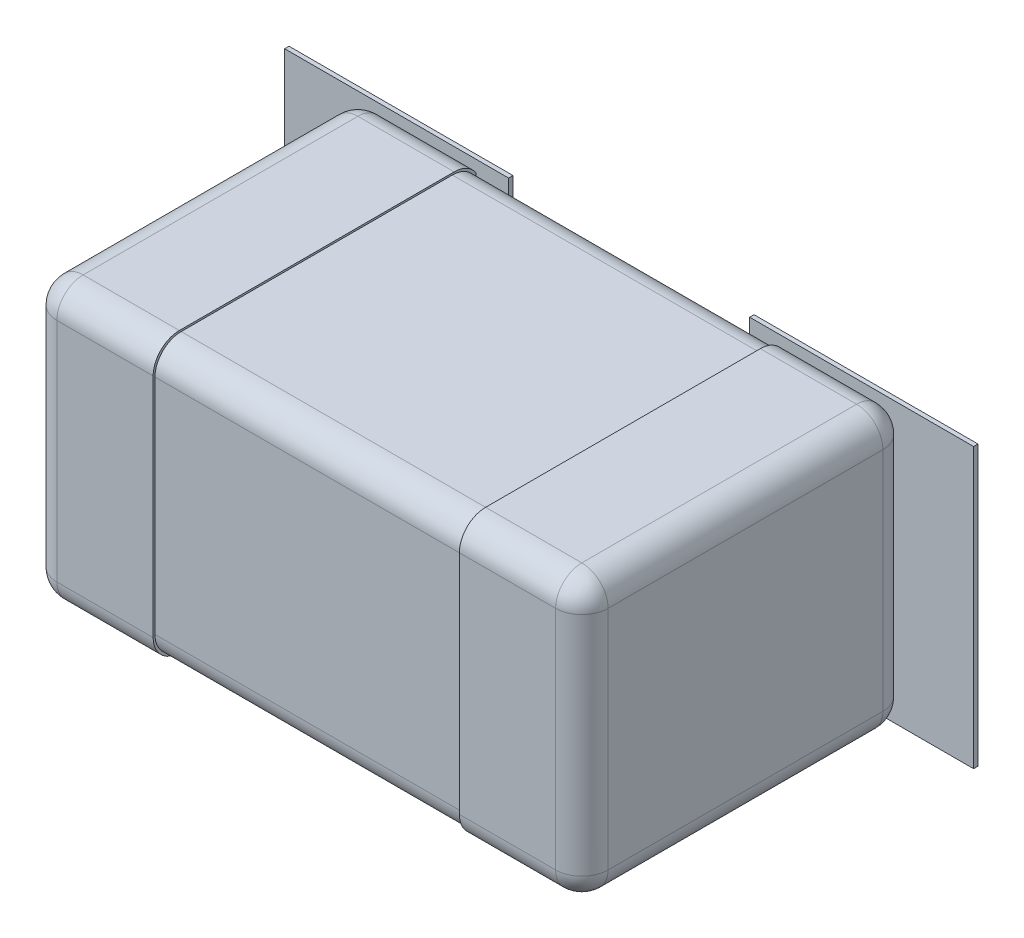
ISO-10303-21;
HEADER;
FILE_DESCRIPTION(('STEP AP214'),'2;1');
FILE_NAME('part.step','',(''),(''),'','','');
FILE_SCHEMA(('AUTOMOTIVE_DESIGN { 1 0 10303 214 1 1 1 1 }'));
ENDSEC;
DATA;
#1=APPLICATION_CONTEXT('core data for automotive mechanical design processes');
#2=APPLICATION_PROTOCOL_DEFINITION('international standard','automotive_design',2000,#1);
#3=PRODUCT_CONTEXT('',#1,'mechanical');
#4=PRODUCT('Part','Part','',(#3));
#5=PRODUCT_RELATED_PRODUCT_CATEGORY('part','',(#4));
#6=PRODUCT_DEFINITION_FORMATION('','',#4);
#7=PRODUCT_DEFINITION_CONTEXT('part definition',#1,'design');
#8=PRODUCT_DEFINITION('design','',#6,#7);
#9=PRODUCT_DEFINITION_SHAPE('','',#8);
#10=(LENGTH_UNIT() NAMED_UNIT(*) SI_UNIT(.MILLI.,.METRE.));
#11=(NAMED_UNIT(*) PLANE_ANGLE_UNIT() SI_UNIT($,.RADIAN.));
#12=(NAMED_UNIT(*) SI_UNIT($,.STERADIAN.) SOLID_ANGLE_UNIT());
#13=UNCERTAINTY_MEASURE_WITH_UNIT(LENGTH_MEASURE(1.E-05),#10,'distance_accuracy_value','');
#14=(GEOMETRIC_REPRESENTATION_CONTEXT(3) GLOBAL_UNCERTAINTY_ASSIGNED_CONTEXT((#13)) GLOBAL_UNIT_ASSIGNED_CONTEXT((#10,
#11,#12)) REPRESENTATION_CONTEXT('',''));
#15=CARTESIAN_POINT('',(0.,0.,0.));
#16=DIRECTION('',(0.,0.,1.));
#17=DIRECTION('',(1.,0.,0.));
#18=AXIS2_PLACEMENT_3D('',#15,#16,#17);
#19=CARTESIAN_POINT('',(0.800000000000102,-0.404999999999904,0.0762));
#20=DIRECTION('',(1.,0.,0.));
#21=DIRECTION('',(0.,0.,-1.));
#22=AXIS2_PLACEMENT_3D('',#19,#20,#21);
#23=PLANE('',#22);
#24=DIRECTION('',(0.,0.,-1.));
#25=VECTOR('',#24,1.);
#26=CARTESIAN_POINT('',(0.800000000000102,0.328799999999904,2.264527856));
#27=LINE('',#26,#25);
#28=CARTESIAN_POINT('',(0.800000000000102,0.328799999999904,0.94996));
#29=VERTEX_POINT('',#28);
#30=CARTESIAN_POINT('',(0.800000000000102,0.328799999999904,0.152399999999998));
#31=VERTEX_POINT('',#30);
#32=EDGE_CURVE('E149',#29,#31,#27,.T.);
#33=ORIENTED_EDGE('',*,*,#32,.F.);
#34=DIRECTION('',(0.,1.,0.));
#35=VECTOR('',#34,1.);
#36=CARTESIAN_POINT('',(0.800000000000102,-1.4609268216,0.94996));
#37=LINE('',#36,#35);
#38=CARTESIAN_POINT('',(0.800000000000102,-0.328799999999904,0.94996));
#39=VERTEX_POINT('',#38);
#40=EDGE_CURVE('E175',#39,#29,#37,.T.);
#41=ORIENTED_EDGE('',*,*,#40,.F.);
#42=DIRECTION('',(0.,0.,-1.));
#43=VECTOR('',#42,1.);
#44=CARTESIAN_POINT('',(0.800000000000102,-0.328799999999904,2.264527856));
#45=LINE('',#44,#43);
#46=CARTESIAN_POINT('',(0.800000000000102,-0.328799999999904,0.1524));
#47=VERTEX_POINT('',#46);
#48=EDGE_CURVE('E157',#47,#39,#45,.F.);
#49=ORIENTED_EDGE('',*,*,#48,.F.);
#50=DIRECTION('',(0.,-1.,0.));
#51=VECTOR('',#50,1.);
#52=CARTESIAN_POINT('',(0.800000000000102,1.4609268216,0.1524));
#53=LINE('',#52,#51);
#54=EDGE_CURVE('E162',#31,#47,#53,.T.);
#55=ORIENTED_EDGE('',*,*,#54,.F.);
#56=EDGE_LOOP('',(#33,#41,#49,#55));
#57=FACE_BOUND('',#56,.T.);
#58=ADVANCED_FACE('F16',(#57),#23,.T.);
#59=CARTESIAN_POINT('',(-0.800000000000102,0.404999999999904,0.0762));
#60=DIRECTION('',(-1.,0.,0.));
#61=DIRECTION('',(0.,0.,1.));
#62=AXIS2_PLACEMENT_3D('',#59,#60,#61);
#63=PLANE('',#62);
#64=DIRECTION('',(0.,0.,-1.));
#65=VECTOR('',#64,1.);
#66=CARTESIAN_POINT('',(-0.800000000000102,0.328799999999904,2.264527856));
#67=LINE('',#66,#65);
#68=CARTESIAN_POINT('',(-0.800000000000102,0.328799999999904,0.1524));
#69=VERTEX_POINT('',#68);
#70=CARTESIAN_POINT('',(-0.800000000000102,0.328799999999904,0.94996));
#71=VERTEX_POINT('',#70);
#72=EDGE_CURVE('E146',#69,#71,#67,.F.);
#73=ORIENTED_EDGE('',*,*,#72,.F.);
#74=DIRECTION('',(0.,1.,0.));
#75=VECTOR('',#74,1.);
#76=CARTESIAN_POINT('',(-0.800000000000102,-1.4609268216,0.1524));
#77=LINE('',#76,#75);
#78=CARTESIAN_POINT('',(-0.800000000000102,-0.328799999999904,0.1524));
#79=VERTEX_POINT('',#78);
#80=EDGE_CURVE('E151',#79,#69,#77,.T.);
#81=ORIENTED_EDGE('',*,*,#80,.F.);
#82=DIRECTION('',(0.,0.,-1.));
#83=VECTOR('',#82,1.);
#84=CARTESIAN_POINT('',(-0.800000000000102,-0.328799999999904,2.264527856));
#85=LINE('',#84,#83);
#86=CARTESIAN_POINT('',(-0.800000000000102,-0.328799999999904,0.94996));
#87=VERTEX_POINT('',#86);
#88=EDGE_CURVE('E113',#87,#79,#85,.T.);
#89=ORIENTED_EDGE('',*,*,#88,.F.);
#90=DIRECTION('',(0.,-1.,0.));
#91=VECTOR('',#90,1.);
#92=CARTESIAN_POINT('',(-0.800000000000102,1.4609268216,0.94996));
#93=LINE('',#92,#91);
#94=EDGE_CURVE('E132',#71,#87,#93,.T.);
#95=ORIENTED_EDGE('',*,*,#94,.F.);
#96=EDGE_LOOP('',(#73,#81,#89,#95));
#97=FACE_BOUND('',#96,.T.);
#98=ADVANCED_FACE('F466',(#97),#63,.T.);
#99=CARTESIAN_POINT('',(-0.723800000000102,-0.328799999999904,2.264527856));
#100=DIRECTION('',(0.,0.,-1.));
#101=DIRECTION('',(-1.,0.,0.));
#102=AXIS2_PLACEMENT_3D('',#99,#100,#101);
#103=CYLINDRICAL_SURFACE('',#102,0.0762);
#104=CARTESIAN_POINT('',(-0.723800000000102,-0.328799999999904,0.1524));
#105=DIRECTION('',(0.,0.,-1.));
#106=DIRECTION('',(-1.,0.,0.));
#107=AXIS2_PLACEMENT_3D('',#104,#105,#106);
#108=CIRCLE('',#107,0.0762);
#109=CARTESIAN_POINT('',(-0.723800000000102,-0.404999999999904,0.1524));
#110=VERTEX_POINT('',#109);
#111=EDGE_CURVE('E665',#110,#79,#108,.T.);
#112=ORIENTED_EDGE('',*,*,#111,.F.);
#113=DIRECTION('',(0.,0.,-1.));
#114=VECTOR('',#113,1.);
#115=CARTESIAN_POINT('',(-0.723800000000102,-0.404999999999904,0.0762));
#116=LINE('',#115,#114);
#117=CARTESIAN_POINT('',(-0.723800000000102,-0.404999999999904,0.949959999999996));
#118=VERTEX_POINT('',#117);
#119=EDGE_CURVE('E130',#118,#110,#116,.T.);
#120=ORIENTED_EDGE('',*,*,#119,.F.);
#121=CARTESIAN_POINT('',(-0.723800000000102,-0.328799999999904,0.94996));
#122=DIRECTION('',(1.05637720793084E-13,-1.05637720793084E-13,1.));
#123=DIRECTION('',(-0.707106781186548,-0.707106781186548,0.));
#124=AXIS2_PLACEMENT_3D('',#121,#122,#123);
#125=CIRCLE('',#124,0.0762);
#126=CARTESIAN_POINT('',(-0.777681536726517,-0.382681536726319,0.94996));
#127=VERTEX_POINT('',#126);
#128=EDGE_CURVE('E123',#127,#118,#125,.T.);
#129=ORIENTED_EDGE('',*,*,#128,.F.);
#130=CARTESIAN_POINT('',(-0.723800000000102,-0.328799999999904,0.94996));
#131=DIRECTION('',(0.,0.,-1.));
#132=DIRECTION('',(-1.,0.,0.));
#133=AXIS2_PLACEMENT_3D('',#130,#131,#132);
#134=CIRCLE('',#133,0.0762);
#135=EDGE_CURVE('E19',#87,#127,#134,.F.);
#136=ORIENTED_EDGE('',*,*,#135,.F.);
#137=ORIENTED_EDGE('',*,*,#88,.T.);
#138=EDGE_LOOP('',(#112,#120,#129,#136,#137));
#139=FACE_BOUND('',#138,.T.);
#140=ADVANCED_FACE('F128',(#139),#103,.T.);
#141=CARTESIAN_POINT('',(-0.723800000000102,-0.328799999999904,0.94996));
#142=DIRECTION('',(-0.707106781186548,-0.707106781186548,0.));
#143=DIRECTION('',(0.,0.,1.));
#144=AXIS2_PLACEMENT_3D('',#141,#142,#143);
#145=SPHERICAL_SURFACE('',#144,0.0762);
#146=ORIENTED_EDGE('',*,*,#135,.T.);
#147=ORIENTED_EDGE('',*,*,#128,.T.);
#148=CARTESIAN_POINT('',(-0.723800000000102,-0.328799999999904,0.94996));
#149=DIRECTION('',(1.,0.,0.));
#150=DIRECTION('',(0.,0.,-1.));
#151=AXIS2_PLACEMENT_3D('',#148,#149,#150);
#152=CIRCLE('',#151,0.0762);
#153=CARTESIAN_POINT('',(-0.723800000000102,-0.328799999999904,1.02616));
#154=VERTEX_POINT('',#153);
#155=EDGE_CURVE('E622',#154,#118,#152,.T.);
#156=ORIENTED_EDGE('',*,*,#155,.F.);
#157=CARTESIAN_POINT('',(-0.723800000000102,-0.328799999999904,0.94996));
#158=DIRECTION('',(0.,-1.,0.));
#159=DIRECTION('',(0.,0.,-1.));
#160=AXIS2_PLACEMENT_3D('',#157,#158,#159);
#161=CIRCLE('',#160,0.0762);
#162=EDGE_CURVE('E125',#87,#154,#161,.F.);
#163=ORIENTED_EDGE('',*,*,#162,.F.);
#164=EDGE_LOOP('',(#146,#147,#156,#163));
#165=FACE_BOUND('',#164,.T.);
#166=ADVANCED_FACE('F121',(#165),#145,.T.);
#167=CARTESIAN_POINT('',(-0.723800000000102,1.4609268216,0.94996));
#168=DIRECTION('',(0.,-1.,0.));
#169=DIRECTION('',(0.,0.,-1.));
#170=AXIS2_PLACEMENT_3D('',#167,#168,#169);
#171=CYLINDRICAL_SURFACE('',#170,0.0762);
#172=ORIENTED_EDGE('',*,*,#162,.T.);
#173=DIRECTION('',(0.,1.,0.));
#174=VECTOR('',#173,1.);
#175=CARTESIAN_POINT('',(-0.723800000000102,0.,1.02616));
#176=LINE('',#175,#174);
#177=CARTESIAN_POINT('',(-0.723800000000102,0.328799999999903,1.02616));
#178=VERTEX_POINT('',#177);
#179=EDGE_CURVE('E445',#178,#154,#176,.F.);
#180=ORIENTED_EDGE('',*,*,#179,.F.);
#181=CARTESIAN_POINT('',(-0.723800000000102,0.328799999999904,0.94996));
#182=DIRECTION('',(0.,1.,0.));
#183=DIRECTION('',(-0.707106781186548,0.,0.707106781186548));
#184=AXIS2_PLACEMENT_3D('',#181,#182,#183);
#185=CIRCLE('',#184,0.0762);
#186=CARTESIAN_POINT('',(-0.777681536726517,0.328799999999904,1.00384153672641));
#187=VERTEX_POINT('',#186);
#188=EDGE_CURVE('E452',#187,#178,#185,.T.);
#189=ORIENTED_EDGE('',*,*,#188,.F.);
#190=CARTESIAN_POINT('',(-0.723800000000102,0.328799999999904,0.94996));
#191=DIRECTION('',(0.,-1.,0.));
#192=DIRECTION('',(0.,0.,-1.));
#193=AXIS2_PLACEMENT_3D('',#190,#191,#192);
#194=CIRCLE('',#193,0.0762);
#195=EDGE_CURVE('E919',#71,#187,#194,.F.);
#196=ORIENTED_EDGE('',*,*,#195,.F.);
#197=ORIENTED_EDGE('',*,*,#94,.T.);
#198=EDGE_LOOP('',(#172,#180,#189,#196,#197));
#199=FACE_BOUND('',#198,.T.);
#200=ADVANCED_FACE('F458',(#199),#171,.T.);
#201=CARTESIAN_POINT('',(-0.723800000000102,0.328799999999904,0.94996));
#202=DIRECTION('',(-0.707106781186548,0.,0.707106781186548));
#203=DIRECTION('',(0.,1.,0.));
#204=AXIS2_PLACEMENT_3D('',#201,#202,#203);
#205=SPHERICAL_SURFACE('',#204,0.0762);
#206=ORIENTED_EDGE('',*,*,#195,.T.);
#207=ORIENTED_EDGE('',*,*,#188,.T.);
#208=CARTESIAN_POINT('',(-0.723800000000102,0.328799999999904,0.94996));
#209=DIRECTION('',(-1.,0.,0.));
#210=DIRECTION('',(0.,0.,1.));
#211=AXIS2_PLACEMENT_3D('',#208,#209,#210);
#212=CIRCLE('',#211,0.0762);
#213=CARTESIAN_POINT('',(-0.723800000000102,0.404999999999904,0.94996));
#214=VERTEX_POINT('',#213);
#215=EDGE_CURVE('E617',#214,#178,#212,.F.);
#216=ORIENTED_EDGE('',*,*,#215,.F.);
#217=CARTESIAN_POINT('',(-0.723800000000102,0.328799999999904,0.94996));
#218=DIRECTION('',(0.,0.,-1.));
#219=DIRECTION('',(-1.,0.,0.));
#220=AXIS2_PLACEMENT_3D('',#217,#218,#219);
#221=CIRCLE('',#220,0.0762);
#222=EDGE_CURVE('E150',#71,#214,#221,.T.);
#223=ORIENTED_EDGE('',*,*,#222,.F.);
#224=EDGE_LOOP('',(#206,#207,#216,#223));
#225=FACE_BOUND('',#224,.T.);
#226=ADVANCED_FACE('F454',(#225),#205,.T.);
#227=CARTESIAN_POINT('',(-0.723800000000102,0.328799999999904,2.264527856));
#228=DIRECTION('',(0.,0.,-1.));
#229=DIRECTION('',(-1.,0.,0.));
#230=AXIS2_PLACEMENT_3D('',#227,#228,#229);
#231=CYLINDRICAL_SURFACE('',#230,0.0762);
#232=CARTESIAN_POINT('',(-0.723800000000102,0.328799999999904,0.1524));
#233=DIRECTION('',(0.,0.,-1.));
#234=DIRECTION('',(-1.,0.,0.));
#235=AXIS2_PLACEMENT_3D('',#232,#233,#234);
#236=CIRCLE('',#235,0.0762);
#237=CARTESIAN_POINT('',(-0.777681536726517,0.382681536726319,0.1524));
#238=VERTEX_POINT('',#237);
#239=EDGE_CURVE('E663',#69,#238,#236,.T.);
#240=ORIENTED_EDGE('',*,*,#239,.F.);
#241=ORIENTED_EDGE('',*,*,#72,.T.);
#242=ORIENTED_EDGE('',*,*,#222,.T.);
#243=DIRECTION('',(0.,0.,1.));
#244=VECTOR('',#243,1.);
#245=CARTESIAN_POINT('',(-0.723800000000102,0.404999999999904,0.0762));
#246=LINE('',#245,#244);
#247=CARTESIAN_POINT('',(-0.723800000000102,0.404999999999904,0.1524));
#248=VERTEX_POINT('',#247);
#249=EDGE_CURVE('E440',#248,#214,#246,.T.);
#250=ORIENTED_EDGE('',*,*,#249,.F.);
#251=CARTESIAN_POINT('',(-0.723800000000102,0.328799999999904,0.1524));
#252=DIRECTION('',(0.,0.,-1.));
#253=DIRECTION('',(-0.707106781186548,0.707106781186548,0.));
#254=AXIS2_PLACEMENT_3D('',#251,#252,#253);
#255=CIRCLE('',#254,0.0762);
#256=EDGE_CURVE('E387',#238,#248,#255,.T.);
#257=ORIENTED_EDGE('',*,*,#256,.F.);
#258=EDGE_LOOP('',(#240,#241,#242,#250,#257));
#259=FACE_BOUND('',#258,.T.);
#260=ADVANCED_FACE('F457',(#259),#231,.T.);
#261=CARTESIAN_POINT('',(0.723800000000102,0.328799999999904,2.264527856));
#262=DIRECTION('',(0.,0.,-1.));
#263=DIRECTION('',(-1.,0.,0.));
#264=AXIS2_PLACEMENT_3D('',#261,#262,#263);
#265=CYLINDRICAL_SURFACE('',#264,0.0762);
#266=CARTESIAN_POINT('',(0.723800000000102,0.328799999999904,0.1524));
#267=DIRECTION('',(0.,0.,-1.));
#268=DIRECTION('',(-1.,0.,0.));
#269=AXIS2_PLACEMENT_3D('',#266,#267,#268);
#270=CIRCLE('',#269,0.0762);
#271=CARTESIAN_POINT('',(0.723800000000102,0.404999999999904,0.1524));
#272=VERTEX_POINT('',#271);
#273=CARTESIAN_POINT('',(0.777681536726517,0.382681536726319,0.1524));
#274=VERTEX_POINT('',#273);
#275=EDGE_CURVE('E324',#272,#274,#270,.T.);
#276=ORIENTED_EDGE('',*,*,#275,.F.);
#277=DIRECTION('',(0.,0.,1.));
#278=VECTOR('',#277,1.);
#279=CARTESIAN_POINT('',(0.723800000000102,0.404999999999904,0.0762));
#280=LINE('',#279,#278);
#281=CARTESIAN_POINT('',(0.723800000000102,0.404999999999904,0.94996));
#282=VERTEX_POINT('',#281);
#283=EDGE_CURVE('E439',#282,#272,#280,.F.);
#284=ORIENTED_EDGE('',*,*,#283,.F.);
#285=CARTESIAN_POINT('',(0.723800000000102,0.328799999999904,0.94996));
#286=DIRECTION('',(0.,0.,-1.));
#287=DIRECTION('',(-1.,0.,0.));
#288=AXIS2_PLACEMENT_3D('',#285,#286,#287);
#289=CIRCLE('',#288,0.0762);
#290=EDGE_CURVE('E167',#29,#282,#289,.F.);
#291=ORIENTED_EDGE('',*,*,#290,.F.);
#292=ORIENTED_EDGE('',*,*,#32,.T.);
#293=CARTESIAN_POINT('',(0.723800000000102,0.328799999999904,0.1524));
#294=DIRECTION('',(0.,0.,-1.));
#295=DIRECTION('',(0.707106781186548,0.707106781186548,0.));
#296=AXIS2_PLACEMENT_3D('',#293,#294,#295);
#297=CIRCLE('',#296,0.0762);
#298=EDGE_CURVE('E321',#274,#31,#297,.T.);
#299=ORIENTED_EDGE('',*,*,#298,.F.);
#300=EDGE_LOOP('',(#276,#284,#291,#292,#299));
#301=FACE_BOUND('',#300,.T.);
#302=ADVANCED_FACE('F433',(#301),#265,.T.);
#303=CARTESIAN_POINT('',(0.723800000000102,0.328799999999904,0.94996));
#304=DIRECTION('',(0.,0.707106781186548,0.707106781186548));
#305=DIRECTION('',(1.,0.,0.));
#306=AXIS2_PLACEMENT_3D('',#303,#304,#305);
#307=SPHERICAL_SURFACE('',#306,0.0762);
#308=CARTESIAN_POINT('',(0.723800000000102,0.328799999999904,0.94996));
#309=DIRECTION('',(0.,1.,0.));
#310=DIRECTION('',(0.,0.,1.));
#311=AXIS2_PLACEMENT_3D('',#308,#309,#310);
#312=CIRCLE('',#311,0.0762);
#313=CARTESIAN_POINT('',(0.723800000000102,0.328799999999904,1.02616));
#314=VERTEX_POINT('',#313);
#315=EDGE_CURVE('E178',#29,#314,#312,.F.);
#316=ORIENTED_EDGE('',*,*,#315,.F.);
#317=ORIENTED_EDGE('',*,*,#290,.T.);
#318=CARTESIAN_POINT('',(0.723800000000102,0.328799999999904,0.94996));
#319=DIRECTION('',(-1.,0.,0.));
#320=DIRECTION('',(0.,0.,1.));
#321=AXIS2_PLACEMENT_3D('',#318,#319,#320);
#322=CIRCLE('',#321,0.0762);
#323=CARTESIAN_POINT('',(0.723800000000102,0.382681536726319,1.00384153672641));
#324=VERTEX_POINT('',#323);
#325=EDGE_CURVE('E588',#324,#282,#322,.T.);
#326=ORIENTED_EDGE('',*,*,#325,.F.);
#327=CARTESIAN_POINT('',(0.723800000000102,0.328799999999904,0.94996));
#328=DIRECTION('',(-1.,0.,0.));
#329=DIRECTION('',(0.,0.,1.));
#330=AXIS2_PLACEMENT_3D('',#327,#328,#329);
#331=CIRCLE('',#330,0.0762);
#332=EDGE_CURVE('E592',#314,#324,#331,.T.);
#333=ORIENTED_EDGE('',*,*,#332,.F.);
#334=EDGE_LOOP('',(#316,#317,#326,#333));
#335=FACE_BOUND('',#334,.T.);
#336=ADVANCED_FACE('F428',(#335),#307,.T.);
#337=CARTESIAN_POINT('',(0.723800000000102,-1.4609268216,0.94996));
#338=DIRECTION('',(0.,1.,0.));
#339=DIRECTION('',(0.,0.,1.));
#340=AXIS2_PLACEMENT_3D('',#337,#338,#339);
#341=CYLINDRICAL_SURFACE('',#340,0.0762);
#342=CARTESIAN_POINT('',(0.723800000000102,-0.328799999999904,0.94996));
#343=DIRECTION('',(0.,1.,0.));
#344=DIRECTION('',(0.,0.,1.));
#345=AXIS2_PLACEMENT_3D('',#342,#343,#344);
#346=CIRCLE('',#345,0.0762);
#347=CARTESIAN_POINT('',(0.777681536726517,-0.328799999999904,1.00384153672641));
#348=VERTEX_POINT('',#347);
#349=EDGE_CURVE('E177',#39,#348,#346,.F.);
#350=ORIENTED_EDGE('',*,*,#349,.F.);
#351=ORIENTED_EDGE('',*,*,#40,.T.);
#352=ORIENTED_EDGE('',*,*,#315,.T.);
#353=DIRECTION('',(0.,1.,0.));
#354=VECTOR('',#353,1.);
#355=CARTESIAN_POINT('',(0.723800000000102,0.,1.02616));
#356=LINE('',#355,#354);
#357=CARTESIAN_POINT('',(0.723800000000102,-0.328799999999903,1.02616));
#358=VERTEX_POINT('',#357);
#359=EDGE_CURVE('E408',#358,#314,#356,.T.);
#360=ORIENTED_EDGE('',*,*,#359,.F.);
#361=CARTESIAN_POINT('',(0.723800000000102,-0.328799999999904,0.94996));
#362=DIRECTION('',(0.,-1.,0.));
#363=DIRECTION('',(0.707106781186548,0.,0.707106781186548));
#364=AXIS2_PLACEMENT_3D('',#361,#362,#363);
#365=CIRCLE('',#364,0.0762);
#366=EDGE_CURVE('E415',#348,#358,#365,.T.);
#367=ORIENTED_EDGE('',*,*,#366,.F.);
#368=EDGE_LOOP('',(#350,#351,#352,#360,#367));
#369=FACE_BOUND('',#368,.T.);
#370=ADVANCED_FACE('F423',(#369),#341,.T.);
#371=CARTESIAN_POINT('',(0.723800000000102,-0.328799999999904,0.94996));
#372=DIRECTION('',(0.707106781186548,0.,0.707106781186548));
#373=DIRECTION('',(0.,-1.,0.));
#374=AXIS2_PLACEMENT_3D('',#371,#372,#373);
#375=SPHERICAL_SURFACE('',#374,0.0762);
#376=ORIENTED_EDGE('',*,*,#366,.T.);
#377=CARTESIAN_POINT('',(0.723800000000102,-0.328799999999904,0.94996));
#378=DIRECTION('',(1.,0.,0.));
#379=DIRECTION('',(0.,0.,-1.));
#380=AXIS2_PLACEMENT_3D('',#377,#378,#379);
#381=CIRCLE('',#380,0.0762);
#382=CARTESIAN_POINT('',(0.723800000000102,-0.404999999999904,0.94996));
#383=VERTEX_POINT('',#382);
#384=EDGE_CURVE('E411',#383,#358,#381,.F.);
#385=ORIENTED_EDGE('',*,*,#384,.F.);
#386=CARTESIAN_POINT('',(0.723800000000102,-0.328799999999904,0.94996));
#387=DIRECTION('',(0.,0.,-1.));
#388=DIRECTION('',(-1.,0.,0.));
#389=AXIS2_PLACEMENT_3D('',#386,#387,#388);
#390=CIRCLE('',#389,0.0762);
#391=EDGE_CURVE('E161',#39,#383,#390,.T.);
#392=ORIENTED_EDGE('',*,*,#391,.F.);
#393=ORIENTED_EDGE('',*,*,#349,.T.);
#394=EDGE_LOOP('',(#376,#385,#392,#393));
#395=FACE_BOUND('',#394,.T.);
#396=ADVANCED_FACE('F418',(#395),#375,.T.);
#397=CARTESIAN_POINT('',(0.723800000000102,-0.328799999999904,2.264527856));
#398=DIRECTION('',(0.,0.,-1.));
#399=DIRECTION('',(-1.,0.,0.));
#400=AXIS2_PLACEMENT_3D('',#397,#398,#399);
#401=CYLINDRICAL_SURFACE('',#400,0.0762);
#402=CARTESIAN_POINT('',(0.723800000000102,-0.328799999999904,0.1524));
#403=DIRECTION('',(0.,0.,-1.));
#404=DIRECTION('',(-1.,0.,0.));
#405=AXIS2_PLACEMENT_3D('',#402,#403,#404);
#406=CIRCLE('',#405,0.0762);
#407=CARTESIAN_POINT('',(0.777681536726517,-0.382681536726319,0.1524));
#408=VERTEX_POINT('',#407);
#409=EDGE_CURVE('E908',#47,#408,#406,.T.);
#410=ORIENTED_EDGE('',*,*,#409,.F.);
#411=ORIENTED_EDGE('',*,*,#48,.T.);
#412=ORIENTED_EDGE('',*,*,#391,.T.);
#413=DIRECTION('',(0.,0.,-1.));
#414=VECTOR('',#413,1.);
#415=CARTESIAN_POINT('',(0.723800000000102,-0.404999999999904,0.0762));
#416=LINE('',#415,#414);
#417=CARTESIAN_POINT('',(0.723800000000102,-0.404999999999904,0.1524));
#418=VERTEX_POINT('',#417);
#419=EDGE_CURVE('E403',#418,#383,#416,.F.);
#420=ORIENTED_EDGE('',*,*,#419,.F.);
#421=CARTESIAN_POINT('',(0.723800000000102,-0.328799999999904,0.1524));
#422=DIRECTION('',(0.,0.,-1.));
#423=DIRECTION('',(0.707106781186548,-0.707106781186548,0.));
#424=AXIS2_PLACEMENT_3D('',#421,#422,#423);
#425=CIRCLE('',#424,0.0762);
#426=EDGE_CURVE('E319',#408,#418,#425,.T.);
#427=ORIENTED_EDGE('',*,*,#426,.F.);
#428=EDGE_LOOP('',(#410,#411,#412,#420,#427));
#429=FACE_BOUND('',#428,.T.);
#430=ADVANCED_FACE('F422',(#429),#401,.T.);
#431=CARTESIAN_POINT('',(0.,0.,0.0762));
#432=DIRECTION('',(0.,0.,1.));
#433=DIRECTION('',(1.,0.,0.));
#434=AXIS2_PLACEMENT_3D('',#431,#432,#433);
#435=PLANE('',#434);
#436=DIRECTION('',(1.,0.,0.));
#437=VECTOR('',#436,1.);
#438=CARTESIAN_POINT('',(-0.999871,-0.405003,0.0762));
#439=LINE('',#438,#437);
#440=CARTESIAN_POINT('',(-0.999871,-0.405003,0.0762));
#441=VERTEX_POINT('',#440);
#442=CARTESIAN_POINT('',(-0.349885,-0.405003,0.0762));
#443=VERTEX_POINT('',#442);
#444=EDGE_CURVE('E397',#441,#443,#439,.T.);
#445=ORIENTED_EDGE('',*,*,#444,.F.);
#446=DIRECTION('',(0.,1.,0.));
#447=VECTOR('',#446,1.);
#448=CARTESIAN_POINT('',(-0.999871,0.405003,0.0762));
#449=LINE('',#448,#447);
#450=CARTESIAN_POINT('',(-0.999871,0.405003,0.0762));
#451=VERTEX_POINT('',#450);
#452=EDGE_CURVE('E139',#451,#441,#449,.F.);
#453=ORIENTED_EDGE('',*,*,#452,.F.);
#454=DIRECTION('',(1.,0.,0.));
#455=VECTOR('',#454,1.);
#456=CARTESIAN_POINT('',(-0.349885,0.405003,0.0762));
#457=LINE('',#456,#455);
#458=CARTESIAN_POINT('',(-0.349885,0.405003,0.0762));
#459=VERTEX_POINT('',#458);
#460=EDGE_CURVE('E384',#459,#451,#457,.F.);
#461=ORIENTED_EDGE('',*,*,#460,.F.);
#462=DIRECTION('',(0.,1.,0.));
#463=VECTOR('',#462,1.);
#464=CARTESIAN_POINT('',(-0.349885,-0.405003,0.0762));
#465=LINE('',#464,#463);
#466=EDGE_CURVE('E390',#443,#459,#465,.T.);
#467=ORIENTED_EDGE('',*,*,#466,.F.);
#468=EDGE_LOOP('',(#445,#453,#461,#467));
#469=FACE_BOUND('',#468,.T.);
#470=ADVANCED_FACE('F976',(#469),#435,.F.);
#471=CARTESIAN_POINT('',(0.,0.,0.0762));
#472=DIRECTION('',(0.,0.,1.));
#473=DIRECTION('',(1.,0.,0.));
#474=AXIS2_PLACEMENT_3D('',#471,#472,#473);
#475=PLANE('',#474);
#476=DIRECTION('',(1.,0.,0.));
#477=VECTOR('',#476,1.);
#478=CARTESIAN_POINT('',(0.349885,-0.405003,0.0762));
#479=LINE('',#478,#477);
#480=CARTESIAN_POINT('',(0.349885,-0.405003,0.0762));
#481=VERTEX_POINT('',#480);
#482=CARTESIAN_POINT('',(0.999871,-0.405003,0.0762));
#483=VERTEX_POINT('',#482);
#484=EDGE_CURVE('E160',#481,#483,#479,.T.);
#485=ORIENTED_EDGE('',*,*,#484,.F.);
#486=DIRECTION('',(0.,1.,0.));
#487=VECTOR('',#486,1.);
#488=CARTESIAN_POINT('',(0.349885,0.405003,0.0762));
#489=LINE('',#488,#487);
#490=CARTESIAN_POINT('',(0.349885,0.405003,0.0762));
#491=VERTEX_POINT('',#490);
#492=EDGE_CURVE('E335',#491,#481,#489,.F.);
#493=ORIENTED_EDGE('',*,*,#492,.F.);
#494=DIRECTION('',(1.,0.,0.));
#495=VECTOR('',#494,1.);
#496=CARTESIAN_POINT('',(0.999871,0.405003,0.0762));
#497=LINE('',#496,#495);
#498=CARTESIAN_POINT('',(0.999871,0.405003,0.0762));
#499=VERTEX_POINT('',#498);
#500=EDGE_CURVE('E345',#499,#491,#497,.F.);
#501=ORIENTED_EDGE('',*,*,#500,.F.);
#502=DIRECTION('',(0.,1.,0.));
#503=VECTOR('',#502,1.);
#504=CARTESIAN_POINT('',(0.999871,-0.405003,0.0762));
#505=LINE('',#504,#503);
#506=EDGE_CURVE('E168',#483,#499,#505,.T.);
#507=ORIENTED_EDGE('',*,*,#506,.F.);
#508=EDGE_LOOP('',(#485,#493,#501,#507));
#509=FACE_BOUND('',#508,.T.);
#510=ADVANCED_FACE('F980',(#509),#475,.F.);
#511=CARTESIAN_POINT('',(0.349885,-0.405003,0.0762));
#512=DIRECTION('',(0.,-1.,0.));
#513=DIRECTION('',(0.,0.,-1.));
#514=AXIS2_PLACEMENT_3D('',#511,#512,#513);
#515=PLANE('',#514);
#516=DIRECTION('',(0.,0.,1.));
#517=VECTOR('',#516,1.);
#518=CARTESIAN_POINT('',(0.349885,-0.405003,0.0762));
#519=LINE('',#518,#517);
#520=CARTESIAN_POINT('',(0.349885,-0.405003,0.0889));
#521=VERTEX_POINT('',#520);
#522=EDGE_CURVE('E362',#481,#521,#519,.T.);
#523=ORIENTED_EDGE('',*,*,#522,.F.);
#524=ORIENTED_EDGE('',*,*,#484,.T.);
#525=DIRECTION('',(0.,0.,-1.));
#526=VECTOR('',#525,1.);
#527=CARTESIAN_POINT('',(0.999871,-0.405003,0.0762));
#528=LINE('',#527,#526);
#529=CARTESIAN_POINT('',(0.999871,-0.405003,0.0889));
#530=VERTEX_POINT('',#529);
#531=EDGE_CURVE('E172',#530,#483,#528,.T.);
#532=ORIENTED_EDGE('',*,*,#531,.F.);
#533=DIRECTION('',(1.,0.,0.));
#534=VECTOR('',#533,1.);
#535=CARTESIAN_POINT('',(0.,-0.405003,0.0889));
#536=LINE('',#535,#534);
#537=EDGE_CURVE('E350',#521,#530,#536,.T.);
#538=ORIENTED_EDGE('',*,*,#537,.F.);
#539=EDGE_LOOP('',(#523,#524,#532,#538));
#540=FACE_BOUND('',#539,.T.);
#541=ADVANCED_FACE('F985',(#540),#515,.T.);
#542=CARTESIAN_POINT('',(0.999871,-0.405003,0.0762));
#543=DIRECTION('',(1.,0.,0.));
#544=DIRECTION('',(0.,0.,-1.));
#545=AXIS2_PLACEMENT_3D('',#542,#543,#544);
#546=PLANE('',#545);
#547=ORIENTED_EDGE('',*,*,#531,.T.);
#548=ORIENTED_EDGE('',*,*,#506,.T.);
#549=DIRECTION('',(0.,0.,1.));
#550=VECTOR('',#549,1.);
#551=CARTESIAN_POINT('',(0.999871,0.405003,0.0762));
#552=LINE('',#551,#550);
#553=CARTESIAN_POINT('',(0.999871,0.405003,0.0889));
#554=VERTEX_POINT('',#553);
#555=EDGE_CURVE('E171',#554,#499,#552,.F.);
#556=ORIENTED_EDGE('',*,*,#555,.F.);
#557=DIRECTION('',(0.,1.,0.));
#558=VECTOR('',#557,1.);
#559=CARTESIAN_POINT('',(0.999871,0.,0.0889));
#560=LINE('',#559,#558);
#561=EDGE_CURVE('E340',#530,#554,#560,.T.);
#562=ORIENTED_EDGE('',*,*,#561,.F.);
#563=EDGE_LOOP('',(#547,#548,#556,#562));
#564=FACE_BOUND('',#563,.T.);
#565=ADVANCED_FACE('F990',(#564),#546,.T.);
#566=CARTESIAN_POINT('',(0.999871,0.405003,0.0762));
#567=DIRECTION('',(0.,1.,0.));
#568=DIRECTION('',(0.,0.,1.));
#569=AXIS2_PLACEMENT_3D('',#566,#567,#568);
#570=PLANE('',#569);
#571=ORIENTED_EDGE('',*,*,#555,.T.);
#572=ORIENTED_EDGE('',*,*,#500,.T.);
#573=DIRECTION('',(0.,0.,1.));
#574=VECTOR('',#573,1.);
#575=CARTESIAN_POINT('',(0.349885,0.405003,0.0762));
#576=LINE('',#575,#574);
#577=CARTESIAN_POINT('',(0.349885,0.405003,0.0889));
#578=VERTEX_POINT('',#577);
#579=EDGE_CURVE('E332',#578,#491,#576,.F.);
#580=ORIENTED_EDGE('',*,*,#579,.F.);
#581=DIRECTION('',(1.,0.,0.));
#582=VECTOR('',#581,1.);
#583=CARTESIAN_POINT('',(0.,0.405003,0.0889));
#584=LINE('',#583,#582);
#585=EDGE_CURVE('E329',#554,#578,#584,.F.);
#586=ORIENTED_EDGE('',*,*,#585,.F.);
#587=EDGE_LOOP('',(#571,#572,#580,#586));
#588=FACE_BOUND('',#587,.T.);
#589=ADVANCED_FACE('F313',(#588),#570,.T.);
#590=CARTESIAN_POINT('',(0.723800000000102,0.328799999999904,0.1524));
#591=DIRECTION('',(0.707106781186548,0.707106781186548,0.));
#592=DIRECTION('',(0.,0.,-1.));
#593=AXIS2_PLACEMENT_3D('',#590,#591,#592);
#594=SPHERICAL_SURFACE('',#593,0.0762);
#595=CARTESIAN_POINT('',(0.723800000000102,0.328799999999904,0.1524));
#596=DIRECTION('',(0.,-1.,0.));
#597=DIRECTION('',(0.,0.,-1.));
#598=AXIS2_PLACEMENT_3D('',#595,#596,#597);
#599=CIRCLE('',#598,0.0762);
#600=CARTESIAN_POINT('',(0.765921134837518,0.328799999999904,0.0889));
#601=VERTEX_POINT('',#600);
#602=EDGE_CURVE('E165',#601,#31,#599,.T.);
#603=ORIENTED_EDGE('',*,*,#602,.F.);
#604=CARTESIAN_POINT('',(0.723800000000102,0.370921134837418,0.0889));
#605=CARTESIAN_POINT('',(0.72854767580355,0.370952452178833,0.0888999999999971));
#606=CARTESIAN_POINT('',(0.733275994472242,0.370123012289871,0.0889000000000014));
#607=CARTESIAN_POINT('',(0.742208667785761,0.366970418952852,0.0889000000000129));
#608=CARTESIAN_POINT('',(0.746413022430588,0.364647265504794,0.0889000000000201));
#609=CARTESIAN_POINT('',(0.753812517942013,0.358735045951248,0.088900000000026));
#610=CARTESIAN_POINT('',(0.757007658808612,0.355145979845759,0.0889000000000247));
#611=CARTESIAN_POINT('',(0.762025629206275,0.34710875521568,0.0889000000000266));
#612=CARTESIAN_POINT('',(0.76384845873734,0.342660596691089,0.0889000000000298));
#613=CARTESIAN_POINT('',(0.765581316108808,0.335011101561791,0.088900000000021));
#614=CARTESIAN_POINT('',(0.765932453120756,0.331903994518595,0.0889000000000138));
#615=CARTESIAN_POINT('',(0.765921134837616,0.328799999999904,0.0889));
#616=B_SPLINE_CURVE_WITH_KNOTS('',3,(#604,#605,#606,#607,#608,#609,#610,#611,#612,#613,#614,
#615),.UNSPECIFIED.,.F.,.F.,(4,2,2,2,2,4),(0.,0.0141430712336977,0.028286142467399,
0.0424292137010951,0.0565722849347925,0.0658755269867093),.UNSPECIFIED.);
#617=CARTESIAN_POINT('',(0.723800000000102,0.370921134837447,0.0889));
#618=VERTEX_POINT('',#617);
#619=EDGE_CURVE('E296',#618,#601,#616,.T.);
#620=ORIENTED_EDGE('',*,*,#619,.F.);
#621=CARTESIAN_POINT('',(0.723800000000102,0.328799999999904,0.1524));
#622=DIRECTION('',(1.,0.,0.));
#623=DIRECTION('',(0.,0.,-1.));
#624=AXIS2_PLACEMENT_3D('',#621,#622,#623);
#625=CIRCLE('',#624,0.0762);
#626=EDGE_CURVE('E598',#272,#618,#625,.F.);
#627=ORIENTED_EDGE('',*,*,#626,.F.);
#628=ORIENTED_EDGE('',*,*,#275,.T.);
#629=ORIENTED_EDGE('',*,*,#298,.T.);
#630=EDGE_LOOP('',(#603,#620,#627,#628,#629));
#631=FACE_BOUND('',#630,.T.);
#632=ADVANCED_FACE('F306',(#631),#594,.T.);
#633=CARTESIAN_POINT('',(0.723800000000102,1.4609268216,0.1524));
#634=DIRECTION('',(0.,-1.,0.));
#635=DIRECTION('',(0.,0.,-1.));
#636=AXIS2_PLACEMENT_3D('',#633,#634,#635);
#637=CYLINDRICAL_SURFACE('',#636,0.0762);
#638=CARTESIAN_POINT('',(0.723800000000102,-0.328799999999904,0.1524));
#639=DIRECTION('',(0.,-1.,0.));
#640=DIRECTION('',(0.,0.,-1.));
#641=AXIS2_PLACEMENT_3D('',#638,#639,#640);
#642=CIRCLE('',#641,0.0762);
#643=CARTESIAN_POINT('',(0.765921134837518,-0.328799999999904,0.0889));
#644=VERTEX_POINT('',#643);
#645=EDGE_CURVE('E164',#644,#47,#642,.T.);
#646=ORIENTED_EDGE('',*,*,#645,.F.);
#647=DIRECTION('',(0.,1.,0.));
#648=VECTOR('',#647,1.);
#649=CARTESIAN_POINT('',(0.76592113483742,0.,0.0889));
#650=LINE('',#649,#648);
#651=EDGE_CURVE('E302',#601,#644,#650,.F.);
#652=ORIENTED_EDGE('',*,*,#651,.F.);
#653=ORIENTED_EDGE('',*,*,#602,.T.);
#654=ORIENTED_EDGE('',*,*,#54,.T.);
#655=EDGE_LOOP('',(#646,#652,#653,#654));
#656=FACE_BOUND('',#655,.T.);
#657=ADVANCED_FACE('F312',(#656),#637,.T.);
#658=CARTESIAN_POINT('',(0.723800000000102,-0.328799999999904,0.1524));
#659=DIRECTION('',(0.707106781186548,-0.707106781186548,0.));
#660=DIRECTION('',(0.,0.,-1.));
#661=AXIS2_PLACEMENT_3D('',#658,#659,#660);
#662=SPHERICAL_SURFACE('',#661,0.0762);
#663=CARTESIAN_POINT('',(0.723800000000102,-0.328799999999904,0.1524));
#664=DIRECTION('',(-1.,0.,0.));
#665=DIRECTION('',(0.,0.,1.));
#666=AXIS2_PLACEMENT_3D('',#663,#664,#665);
#667=CIRCLE('',#666,0.0762);
#668=CARTESIAN_POINT('',(0.723800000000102,-0.370921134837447,0.0889));
#669=VERTEX_POINT('',#668);
#670=EDGE_CURVE('E578',#669,#418,#667,.T.);
#671=ORIENTED_EDGE('',*,*,#670,.F.);
#672=CARTESIAN_POINT('',(0.765921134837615,-0.328799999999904,0.0889));
#673=CARTESIAN_POINT('',(0.765952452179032,-0.333547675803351,0.0888999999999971));
#674=CARTESIAN_POINT('',(0.765123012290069,-0.338275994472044,0.0889000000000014));
#675=CARTESIAN_POINT('',(0.76197041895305,-0.347208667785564,0.0889000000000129));
#676=CARTESIAN_POINT('',(0.759647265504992,-0.35141302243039,0.0889000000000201));
#677=CARTESIAN_POINT('',(0.753735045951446,-0.358812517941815,0.088900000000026));
#678=CARTESIAN_POINT('',(0.750145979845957,-0.362007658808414,0.0889000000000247));
#679=CARTESIAN_POINT('',(0.742108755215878,-0.367025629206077,0.0889000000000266));
#680=CARTESIAN_POINT('',(0.737660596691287,-0.368848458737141,0.0889000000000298));
#681=CARTESIAN_POINT('',(0.730011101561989,-0.37058131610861,0.088900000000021));
#682=CARTESIAN_POINT('',(0.726903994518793,-0.370932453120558,0.0889000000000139));
#683=CARTESIAN_POINT('',(0.723800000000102,-0.370921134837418,0.0889));
#684=B_SPLINE_CURVE_WITH_KNOTS('',3,(#672,#673,#674,#675,#676,#677,#678,#679,#680,#681,#682,
#683),.UNSPECIFIED.,.F.,.F.,(4,2,2,2,2,4),(0.,0.0141430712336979,0.0282861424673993,
0.0424292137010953,0.0565722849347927,0.0658755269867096),.UNSPECIFIED.);
#685=EDGE_CURVE('E290',#644,#669,#684,.T.);
#686=ORIENTED_EDGE('',*,*,#685,.F.);
#687=ORIENTED_EDGE('',*,*,#645,.T.);
#688=ORIENTED_EDGE('',*,*,#409,.T.);
#689=ORIENTED_EDGE('',*,*,#426,.T.);
#690=EDGE_LOOP('',(#671,#686,#687,#688,#689));
#691=FACE_BOUND('',#690,.T.);
#692=ADVANCED_FACE('F672',(#691),#662,.T.);
#693=CARTESIAN_POINT('',(-0.723800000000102,-0.328799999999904,0.1524));
#694=DIRECTION('',(-0.707106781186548,0.,-0.707106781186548));
#695=DIRECTION('',(0.,-1.,0.));
#696=AXIS2_PLACEMENT_3D('',#693,#694,#695);
#697=SPHERICAL_SURFACE('',#696,0.0762);
#698=CARTESIAN_POINT('',(-0.723800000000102,-0.328799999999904,0.1524));
#699=DIRECTION('',(0.,1.,0.));
#700=DIRECTION('',(0.,0.,1.));
#701=AXIS2_PLACEMENT_3D('',#698,#699,#700);
#702=CIRCLE('',#701,0.0762);
#703=CARTESIAN_POINT('',(-0.765921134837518,-0.328799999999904,0.0889));
#704=VERTEX_POINT('',#703);
#705=CARTESIAN_POINT('',(-0.777681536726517,-0.328799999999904,0.0985184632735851));
#706=VERTEX_POINT('',#705);
#707=EDGE_CURVE('E34',#704,#706,#702,.T.);
#708=ORIENTED_EDGE('',*,*,#707,.F.);
#709=CARTESIAN_POINT('',(-0.723800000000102,-0.370921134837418,0.0888999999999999));
#710=CARTESIAN_POINT('',(-0.728547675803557,-0.370952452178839,0.0889000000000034));
#711=CARTESIAN_POINT('',(-0.733275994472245,-0.37012301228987,0.0889000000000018));
#712=CARTESIAN_POINT('',(-0.742208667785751,-0.366970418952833,0.0888999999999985));
#713=CARTESIAN_POINT('',(-0.746413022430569,-0.364647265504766,0.0888999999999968));
#714=CARTESIAN_POINT('',(-0.753812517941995,-0.358735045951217,0.0889000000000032));
#715=CARTESIAN_POINT('',(-0.757007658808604,-0.355145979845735,0.0889000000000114));
#716=CARTESIAN_POINT('',(-0.762025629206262,-0.347108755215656,0.0889000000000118));
#717=CARTESIAN_POINT('',(-0.76384845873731,-0.342660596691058,0.088900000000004));
#718=CARTESIAN_POINT('',(-0.765581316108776,-0.335011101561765,0.0888999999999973));
#719=CARTESIAN_POINT('',(-0.76593245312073,-0.33190399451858,0.0888999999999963));
#720=CARTESIAN_POINT('',(-0.765921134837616,-0.328799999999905,0.0889000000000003));
#721=B_SPLINE_CURVE_WITH_KNOTS('',3,(#709,#710,#711,#712,#713,#714,#715,#716,#717,#718,#719,
#720),.UNSPECIFIED.,.F.,.F.,(4,2,2,2,2,4),(0.,0.0141430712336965,0.0282861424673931,
0.0424292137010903,0.0565722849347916,0.0658755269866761),.UNSPECIFIED.);
#722=CARTESIAN_POINT('',(-0.723800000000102,-0.370921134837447,0.0889));
#723=VERTEX_POINT('',#722);
#724=EDGE_CURVE('E262',#723,#704,#721,.T.);
#725=ORIENTED_EDGE('',*,*,#724,.F.);
#726=CARTESIAN_POINT('',(-0.723800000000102,-0.328799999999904,0.1524));
#727=DIRECTION('',(-1.,0.,0.));
#728=DIRECTION('',(0.,0.,1.));
#729=AXIS2_PLACEMENT_3D('',#726,#727,#728);
#730=CIRCLE('',#729,0.0762);
#731=EDGE_CURVE('E400',#110,#723,#730,.F.);
#732=ORIENTED_EDGE('',*,*,#731,.F.);
#733=ORIENTED_EDGE('',*,*,#111,.T.);
#734=CARTESIAN_POINT('',(-0.723800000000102,-0.328799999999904,0.1524));
#735=DIRECTION('',(0.,1.,0.));
#736=DIRECTION('',(0.,0.,1.));
#737=AXIS2_PLACEMENT_3D('',#734,#735,#736);
#738=CIRCLE('',#737,0.0762);
#739=EDGE_CURVE('E155',#706,#79,#738,.T.);
#740=ORIENTED_EDGE('',*,*,#739,.F.);
#741=EDGE_LOOP('',(#708,#725,#732,#733,#740));
#742=FACE_BOUND('',#741,.T.);
#743=ADVANCED_FACE('F668',(#742),#697,.T.);
#744=CARTESIAN_POINT('',(-0.723800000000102,-1.4609268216,0.1524));
#745=DIRECTION('',(0.,1.,0.));
#746=DIRECTION('',(0.,0.,1.));
#747=AXIS2_PLACEMENT_3D('',#744,#745,#746);
#748=CYLINDRICAL_SURFACE('',#747,0.0762);
#749=CARTESIAN_POINT('',(-0.723800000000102,0.328799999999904,0.1524));
#750=DIRECTION('',(0.,1.,0.));
#751=DIRECTION('',(0.,0.,1.));
#752=AXIS2_PLACEMENT_3D('',#749,#750,#751);
#753=CIRCLE('',#752,0.0762);
#754=CARTESIAN_POINT('',(-0.765921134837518,0.328799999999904,0.0889));
#755=VERTEX_POINT('',#754);
#756=EDGE_CURVE('E154',#755,#69,#753,.T.);
#757=ORIENTED_EDGE('',*,*,#756,.F.);
#758=DIRECTION('',(0.,1.,0.));
#759=VECTOR('',#758,1.);
#760=CARTESIAN_POINT('',(-0.76592113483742,0.,0.0889));
#761=LINE('',#760,#759);
#762=EDGE_CURVE('E261',#704,#755,#761,.T.);
#763=ORIENTED_EDGE('',*,*,#762,.F.);
#764=ORIENTED_EDGE('',*,*,#707,.T.);
#765=ORIENTED_EDGE('',*,*,#739,.T.);
#766=ORIENTED_EDGE('',*,*,#80,.T.);
#767=EDGE_LOOP('',(#757,#763,#764,#765,#766));
#768=FACE_BOUND('',#767,.T.);
#769=ADVANCED_FACE('F671',(#768),#748,.T.);
#770=CARTESIAN_POINT('',(-0.723800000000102,0.328799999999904,0.1524));
#771=DIRECTION('',(-0.707106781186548,0.707106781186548,0.));
#772=DIRECTION('',(0.,0.,-1.));
#773=AXIS2_PLACEMENT_3D('',#770,#771,#772);
#774=SPHERICAL_SURFACE('',#773,0.0762);
#775=CARTESIAN_POINT('',(-0.723800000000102,0.328799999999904,0.1524));
#776=DIRECTION('',(1.,0.,0.));
#777=DIRECTION('',(0.,0.,-1.));
#778=AXIS2_PLACEMENT_3D('',#775,#776,#777);
#779=CIRCLE('',#778,0.0762);
#780=CARTESIAN_POINT('',(-0.723800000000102,0.370921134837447,0.0889));
#781=VERTEX_POINT('',#780);
#782=EDGE_CURVE('E612',#781,#248,#779,.T.);
#783=ORIENTED_EDGE('',*,*,#782,.F.);
#784=CARTESIAN_POINT('',(-0.765921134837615,0.328799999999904,0.0889));
#785=CARTESIAN_POINT('',(-0.765952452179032,0.333547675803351,0.0888999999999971));
#786=CARTESIAN_POINT('',(-0.765123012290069,0.338275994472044,0.0889000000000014));
#787=CARTESIAN_POINT('',(-0.76197041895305,0.347208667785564,0.0889000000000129));
#788=CARTESIAN_POINT('',(-0.759647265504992,0.35141302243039,0.0889000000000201));
#789=CARTESIAN_POINT('',(-0.753735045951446,0.358812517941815,0.088900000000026));
#790=CARTESIAN_POINT('',(-0.750145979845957,0.362007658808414,0.0889000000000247));
#791=CARTESIAN_POINT('',(-0.742108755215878,0.367025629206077,0.0889000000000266));
#792=CARTESIAN_POINT('',(-0.737660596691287,0.368848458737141,0.0889000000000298));
#793=CARTESIAN_POINT('',(-0.730011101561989,0.37058131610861,0.088900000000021));
#794=CARTESIAN_POINT('',(-0.726903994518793,0.370932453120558,0.0889000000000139));
#795=CARTESIAN_POINT('',(-0.723800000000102,0.370921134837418,0.0889));
#796=B_SPLINE_CURVE_WITH_KNOTS('',3,(#784,#785,#786,#787,#788,#789,#790,#791,#792,#793,#794,
#795),.UNSPECIFIED.,.F.,.F.,(4,2,2,2,2,4),(0.,0.0141430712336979,0.0282861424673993,
0.0424292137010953,0.0565722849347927,0.0658755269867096),.UNSPECIFIED.);
#797=EDGE_CURVE('E252',#755,#781,#796,.T.);
#798=ORIENTED_EDGE('',*,*,#797,.F.);
#799=ORIENTED_EDGE('',*,*,#756,.T.);
#800=ORIENTED_EDGE('',*,*,#239,.T.);
#801=ORIENTED_EDGE('',*,*,#256,.T.);
#802=EDGE_LOOP('',(#783,#798,#799,#800,#801));
#803=FACE_BOUND('',#802,.T.);
#804=ADVANCED_FACE('F268',(#803),#774,.T.);
#805=CARTESIAN_POINT('',(-0.349885,0.405003,0.0762));
#806=DIRECTION('',(0.,1.,0.));
#807=DIRECTION('',(0.,0.,1.));
#808=AXIS2_PLACEMENT_3D('',#805,#806,#807);
#809=PLANE('',#808);
#810=DIRECTION('',(0.,0.,-1.));
#811=VECTOR('',#810,1.);
#812=CARTESIAN_POINT('',(-0.349885,0.405003,0.0762));
#813=LINE('',#812,#811);
#814=CARTESIAN_POINT('',(-0.349885,0.405003,0.0889));
#815=VERTEX_POINT('',#814);
#816=EDGE_CURVE('E393',#459,#815,#813,.F.);
#817=ORIENTED_EDGE('',*,*,#816,.F.);
#818=ORIENTED_EDGE('',*,*,#460,.T.);
#819=DIRECTION('',(0.,0.,1.));
#820=VECTOR('',#819,1.);
#821=CARTESIAN_POINT('',(-0.999871,0.405003,0.0762));
#822=LINE('',#821,#820);
#823=CARTESIAN_POINT('',(-0.999871,0.405003,0.0889));
#824=VERTEX_POINT('',#823);
#825=EDGE_CURVE('E143',#824,#451,#822,.F.);
#826=ORIENTED_EDGE('',*,*,#825,.F.);
#827=DIRECTION('',(1.,0.,0.));
#828=VECTOR('',#827,1.);
#829=CARTESIAN_POINT('',(0.,0.405003,0.0889));
#830=LINE('',#829,#828);
#831=EDGE_CURVE('E641',#815,#824,#830,.F.);
#832=ORIENTED_EDGE('',*,*,#831,.F.);
#833=EDGE_LOOP('',(#817,#818,#826,#832));
#834=FACE_BOUND('',#833,.T.);
#835=ADVANCED_FACE('F873',(#834),#809,.T.);
#836=CARTESIAN_POINT('',(-0.999871,0.405003,0.0762));
#837=DIRECTION('',(-1.,0.,0.));
#838=DIRECTION('',(0.,0.,1.));
#839=AXIS2_PLACEMENT_3D('',#836,#837,#838);
#840=PLANE('',#839);
#841=ORIENTED_EDGE('',*,*,#825,.T.);
#842=ORIENTED_EDGE('',*,*,#452,.T.);
#843=DIRECTION('',(0.,0.,-1.));
#844=VECTOR('',#843,1.);
#845=CARTESIAN_POINT('',(-0.999871,-0.405003,0.0762));
#846=LINE('',#845,#844);
#847=CARTESIAN_POINT('',(-0.999871,-0.405003,0.0889));
#848=VERTEX_POINT('',#847);
#849=EDGE_CURVE('E142',#848,#441,#846,.T.);
#850=ORIENTED_EDGE('',*,*,#849,.F.);
#851=DIRECTION('',(0.,1.,0.));
#852=VECTOR('',#851,1.);
#853=CARTESIAN_POINT('',(-0.999871,0.,0.0889));
#854=LINE('',#853,#852);
#855=EDGE_CURVE('E632',#824,#848,#854,.F.);
#856=ORIENTED_EDGE('',*,*,#855,.F.);
#857=EDGE_LOOP('',(#841,#842,#850,#856));
#858=FACE_BOUND('',#857,.T.);
#859=ADVANCED_FACE('F878',(#858),#840,.T.);
#860=CARTESIAN_POINT('',(-0.999871,-0.405003,0.0762));
#861=DIRECTION('',(0.,-1.,0.));
#862=DIRECTION('',(0.,0.,-1.));
#863=AXIS2_PLACEMENT_3D('',#860,#861,#862);
#864=PLANE('',#863);
#865=ORIENTED_EDGE('',*,*,#849,.T.);
#866=ORIENTED_EDGE('',*,*,#444,.T.);
#867=DIRECTION('',(0.,0.,-1.));
#868=VECTOR('',#867,1.);
#869=CARTESIAN_POINT('',(-0.349885,-0.405003,0.0762));
#870=LINE('',#869,#868);
#871=CARTESIAN_POINT('',(-0.349885,-0.405003,0.0889));
#872=VERTEX_POINT('',#871);
#873=EDGE_CURVE('E394',#872,#443,#870,.T.);
#874=ORIENTED_EDGE('',*,*,#873,.F.);
#875=DIRECTION('',(1.,0.,0.));
#876=VECTOR('',#875,1.);
#877=CARTESIAN_POINT('',(0.,-0.405003,0.0889));
#878=LINE('',#877,#876);
#879=EDGE_CURVE('E572',#848,#872,#878,.T.);
#880=ORIENTED_EDGE('',*,*,#879,.F.);
#881=EDGE_LOOP('',(#865,#866,#874,#880));
#882=FACE_BOUND('',#881,.T.);
#883=ADVANCED_FACE('F881',(#882),#864,.T.);
#884=CARTESIAN_POINT('',(3.6067346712,-0.328799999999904,0.1524));
#885=DIRECTION('',(-1.,0.,0.));
#886=DIRECTION('',(0.,0.,1.));
#887=AXIS2_PLACEMENT_3D('',#884,#885,#886);
#888=CYLINDRICAL_SURFACE('',#887,0.0762);
#889=ORIENTED_EDGE('',*,*,#731,.T.);
#890=DIRECTION('',(1.,0.,0.));
#891=VECTOR('',#890,1.);
#892=CARTESIAN_POINT('',(0.,-0.370921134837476,0.0889));
#893=LINE('',#892,#891);
#894=CARTESIAN_POINT('',(-0.444400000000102,-0.370921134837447,0.0889));
#895=VERTEX_POINT('',#894);
#896=EDGE_CURVE('E546',#895,#723,#893,.F.);
#897=ORIENTED_EDGE('',*,*,#896,.F.);
#898=CARTESIAN_POINT('',(-0.444400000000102,-0.328799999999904,0.1524));
#899=DIRECTION('',(-1.,0.,0.));
#900=DIRECTION('',(0.,0.,1.));
#901=AXIS2_PLACEMENT_3D('',#898,#899,#900);
#902=CIRCLE('',#901,0.0762);
#903=CARTESIAN_POINT('',(-0.444400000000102,-0.404999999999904,0.1524));
#904=VERTEX_POINT('',#903);
#905=EDGE_CURVE('E248',#895,#904,#902,.T.);
#906=ORIENTED_EDGE('',*,*,#905,.T.);
#907=DIRECTION('',(1.,0.,0.));
#908=VECTOR('',#907,1.);
#909=CARTESIAN_POINT('',(-0.800000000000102,-0.404999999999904,0.1524));
#910=LINE('',#909,#908);
#911=EDGE_CURVE('E623',#110,#904,#910,.T.);
#912=ORIENTED_EDGE('',*,*,#911,.F.);
#913=EDGE_LOOP('',(#889,#897,#906,#912));
#914=FACE_BOUND('',#913,.T.);
#915=ADVANCED_FACE('F890',(#914),#888,.T.);
#916=CARTESIAN_POINT('',(-0.800000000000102,-0.404999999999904,0.0762));
#917=DIRECTION('',(0.,-1.,0.));
#918=DIRECTION('',(0.,0.,-1.));
#919=AXIS2_PLACEMENT_3D('',#916,#917,#918);
#920=PLANE('',#919);
#921=DIRECTION('',(0.,0.,1.));
#922=VECTOR('',#921,1.);
#923=CARTESIAN_POINT('',(-0.444400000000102,-0.404999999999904,0.0762));
#924=LINE('',#923,#922);
#925=CARTESIAN_POINT('',(-0.444400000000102,-0.404999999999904,0.94996));
#926=VERTEX_POINT('',#925);
#927=EDGE_CURVE('E247',#904,#926,#924,.T.);
#928=ORIENTED_EDGE('',*,*,#927,.T.);
#929=DIRECTION('',(1.,0.,0.));
#930=VECTOR('',#929,1.);
#931=CARTESIAN_POINT('',(-3.6067346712,-0.404999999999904,0.94996));
#932=LINE('',#931,#930);
#933=EDGE_CURVE('E449',#118,#926,#932,.T.);
#934=ORIENTED_EDGE('',*,*,#933,.F.);
#935=ORIENTED_EDGE('',*,*,#119,.T.);
#936=ORIENTED_EDGE('',*,*,#911,.T.);
#937=EDGE_LOOP('',(#928,#934,#935,#936));
#938=FACE_BOUND('',#937,.T.);
#939=ADVANCED_FACE('F892',(#938),#920,.T.);
#940=CARTESIAN_POINT('',(-3.6067346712,-0.328799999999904,0.94996));
#941=DIRECTION('',(1.,0.,0.));
#942=DIRECTION('',(0.,0.,-1.));
#943=AXIS2_PLACEMENT_3D('',#940,#941,#942);
#944=CYLINDRICAL_SURFACE('',#943,0.0762);
#945=ORIENTED_EDGE('',*,*,#933,.T.);
#946=CARTESIAN_POINT('',(-0.444400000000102,-0.328799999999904,0.94996));
#947=DIRECTION('',(1.,0.,0.));
#948=DIRECTION('',(0.,0.,-1.));
#949=AXIS2_PLACEMENT_3D('',#946,#947,#948);
#950=CIRCLE('',#949,0.0762);
#951=CARTESIAN_POINT('',(-0.444400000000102,-0.328799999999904,1.02616));
#952=VERTEX_POINT('',#951);
#953=EDGE_CURVE('E244',#926,#952,#950,.F.);
#954=ORIENTED_EDGE('',*,*,#953,.T.);
#955=DIRECTION('',(1.,0.,0.));
#956=VECTOR('',#955,1.);
#957=CARTESIAN_POINT('',(0.,-0.328799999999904,1.02616));
#958=LINE('',#957,#956);
#959=EDGE_CURVE('E448',#154,#952,#958,.T.);
#960=ORIENTED_EDGE('',*,*,#959,.F.);
#961=ORIENTED_EDGE('',*,*,#155,.T.);
#962=EDGE_LOOP('',(#945,#954,#960,#961));
#963=FACE_BOUND('',#962,.T.);
#964=ADVANCED_FACE('F898',(#963),#944,.T.);
#965=CARTESIAN_POINT('',(0.,0.,1.02616));
#966=DIRECTION('',(0.,0.,1.));
#967=DIRECTION('',(1.,0.,0.));
#968=AXIS2_PLACEMENT_3D('',#965,#966,#967);
#969=PLANE('',#968);
#970=ORIENTED_EDGE('',*,*,#179,.T.);
#971=ORIENTED_EDGE('',*,*,#959,.T.);
#972=DIRECTION('',(0.,1.,0.));
#973=VECTOR('',#972,1.);
#974=CARTESIAN_POINT('',(-0.444400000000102,-0.404999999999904,1.02616));
#975=LINE('',#974,#973);
#976=CARTESIAN_POINT('',(-0.444400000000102,0.328799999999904,1.02616));
#977=VERTEX_POINT('',#976);
#978=EDGE_CURVE('E243',#952,#977,#975,.T.);
#979=ORIENTED_EDGE('',*,*,#978,.T.);
#980=DIRECTION('',(-1.,0.,0.));
#981=VECTOR('',#980,1.);
#982=CARTESIAN_POINT('',(3.6067346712,0.328799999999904,1.02616));
#983=LINE('',#982,#981);
#984=EDGE_CURVE('E444',#178,#977,#983,.F.);
#985=ORIENTED_EDGE('',*,*,#984,.F.);
#986=EDGE_LOOP('',(#970,#971,#979,#985));
#987=FACE_BOUND('',#986,.T.);
#988=ADVANCED_FACE('F925',(#987),#969,.T.);
#989=CARTESIAN_POINT('',(3.6067346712,0.328799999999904,0.94996));
#990=DIRECTION('',(-1.,0.,0.));
#991=DIRECTION('',(0.,0.,1.));
#992=AXIS2_PLACEMENT_3D('',#989,#990,#991);
#993=CYLINDRICAL_SURFACE('',#992,0.0762);
#994=ORIENTED_EDGE('',*,*,#984,.T.);
#995=CARTESIAN_POINT('',(-0.444400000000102,0.328799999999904,0.94996));
#996=DIRECTION('',(-1.,0.,0.));
#997=DIRECTION('',(0.,0.,1.));
#998=AXIS2_PLACEMENT_3D('',#995,#996,#997);
#999=CIRCLE('',#998,0.0762);
#1000=CARTESIAN_POINT('',(-0.444400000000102,0.404999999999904,0.94996));
#1001=VERTEX_POINT('',#1000);
#1002=EDGE_CURVE('E240',#977,#1001,#999,.T.);
#1003=ORIENTED_EDGE('',*,*,#1002,.T.);
#1004=DIRECTION('',(1.,0.,0.));
#1005=VECTOR('',#1004,1.);
#1006=CARTESIAN_POINT('',(0.800000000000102,0.404999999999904,0.94996));
#1007=LINE('',#1006,#1005);
#1008=EDGE_CURVE('E443',#214,#1001,#1007,.T.);
#1009=ORIENTED_EDGE('',*,*,#1008,.F.);
#1010=ORIENTED_EDGE('',*,*,#215,.T.);
#1011=EDGE_LOOP('',(#994,#1003,#1009,#1010));
#1012=FACE_BOUND('',#1011,.T.);
#1013=ADVANCED_FACE('F928',(#1012),#993,.T.);
#1014=CARTESIAN_POINT('',(0.800000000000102,0.404999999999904,0.0762));
#1015=DIRECTION('',(0.,1.,0.));
#1016=DIRECTION('',(0.,0.,1.));
#1017=AXIS2_PLACEMENT_3D('',#1014,#1015,#1016);
#1018=PLANE('',#1017);
#1019=ORIENTED_EDGE('',*,*,#249,.T.);
#1020=ORIENTED_EDGE('',*,*,#1008,.T.);
#1021=DIRECTION('',(0.,0.,1.));
#1022=VECTOR('',#1021,1.);
#1023=CARTESIAN_POINT('',(-0.444400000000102,0.404999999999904,0.0762));
#1024=LINE('',#1023,#1022);
#1025=CARTESIAN_POINT('',(-0.444400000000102,0.404999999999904,0.1524));
#1026=VERTEX_POINT('',#1025);
#1027=EDGE_CURVE('E239',#1001,#1026,#1024,.F.);
#1028=ORIENTED_EDGE('',*,*,#1027,.T.);
#1029=DIRECTION('',(1.,0.,0.));
#1030=VECTOR('',#1029,1.);
#1031=CARTESIAN_POINT('',(-3.6067346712,0.404999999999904,0.1524));
#1032=LINE('',#1031,#1030);
#1033=EDGE_CURVE('E605',#248,#1026,#1032,.T.);
#1034=ORIENTED_EDGE('',*,*,#1033,.F.);
#1035=EDGE_LOOP('',(#1019,#1020,#1028,#1034));
#1036=FACE_BOUND('',#1035,.T.);
#1037=ADVANCED_FACE('F936',(#1036),#1018,.T.);
#1038=CARTESIAN_POINT('',(-3.6067346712,0.328799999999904,0.1524));
#1039=DIRECTION('',(1.,0.,0.));
#1040=DIRECTION('',(0.,0.,-1.));
#1041=AXIS2_PLACEMENT_3D('',#1038,#1039,#1040);
#1042=CYLINDRICAL_SURFACE('',#1041,0.0762);
#1043=CARTESIAN_POINT('',(-0.444400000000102,0.328799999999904,0.1524));
#1044=DIRECTION('',(1.,0.,0.));
#1045=DIRECTION('',(0.,0.,-1.));
#1046=AXIS2_PLACEMENT_3D('',#1043,#1044,#1045);
#1047=CIRCLE('',#1046,0.0762);
#1048=CARTESIAN_POINT('',(-0.444400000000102,0.370921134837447,0.0889));
#1049=VERTEX_POINT('',#1048);
#1050=EDGE_CURVE('E236',#1026,#1049,#1047,.F.);
#1051=ORIENTED_EDGE('',*,*,#1050,.T.);
#1052=DIRECTION('',(1.,0.,0.));
#1053=VECTOR('',#1052,1.);
#1054=CARTESIAN_POINT('',(0.,0.370921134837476,0.0889));
#1055=LINE('',#1054,#1053);
#1056=EDGE_CURVE('E260',#781,#1049,#1055,.T.);
#1057=ORIENTED_EDGE('',*,*,#1056,.F.);
#1058=ORIENTED_EDGE('',*,*,#782,.T.);
#1059=ORIENTED_EDGE('',*,*,#1033,.T.);
#1060=EDGE_LOOP('',(#1051,#1057,#1058,#1059));
#1061=FACE_BOUND('',#1060,.T.);
#1062=ADVANCED_FACE('F950',(#1061),#1042,.T.);
#1063=CARTESIAN_POINT('',(-0.444400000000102,0.404999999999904,1.020826));
#1064=DIRECTION('',(0.,0.,-1.));
#1065=DIRECTION('',(-1.,0.,0.));
#1066=AXIS2_PLACEMENT_3D('',#1063,#1064,#1065);
#1067=PLANE('',#1066);
#1068=DIRECTION('',(0.,1.,0.));
#1069=VECTOR('',#1068,1.);
#1070=CARTESIAN_POINT('',(0.444400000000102,-0.404999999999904,1.020826));
#1071=LINE('',#1070,#1069);
#1072=CARTESIAN_POINT('',(0.444400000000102,-0.323465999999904,1.020826));
#1073=VERTEX_POINT('',#1072);
#1074=CARTESIAN_POINT('',(0.444400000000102,0.323465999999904,1.020826));
#1075=VERTEX_POINT('',#1074);
#1076=EDGE_CURVE('E218',#1073,#1075,#1071,.T.);
#1077=ORIENTED_EDGE('',*,*,#1076,.T.);
#1078=DIRECTION('',(-1.,0.,0.));
#1079=VECTOR('',#1078,1.);
#1080=CARTESIAN_POINT('',(3.6067346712,0.323465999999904,1.020826));
#1081=LINE('',#1080,#1079);
#1082=CARTESIAN_POINT('',(-0.444400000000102,0.323465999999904,1.020826));
#1083=VERTEX_POINT('',#1082);
#1084=EDGE_CURVE('E602',#1083,#1075,#1081,.F.);
#1085=ORIENTED_EDGE('',*,*,#1084,.F.);
#1086=DIRECTION('',(0.,1.,0.));
#1087=VECTOR('',#1086,1.);
#1088=CARTESIAN_POINT('',(-0.444400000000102,-0.404999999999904,1.020826));
#1089=LINE('',#1088,#1087);
#1090=CARTESIAN_POINT('',(-0.444400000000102,-0.323465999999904,1.020826));
#1091=VERTEX_POINT('',#1090);
#1092=EDGE_CURVE('E227',#1083,#1091,#1089,.F.);
#1093=ORIENTED_EDGE('',*,*,#1092,.T.);
#1094=DIRECTION('',(-1.,0.,0.));
#1095=VECTOR('',#1094,1.);
#1096=CARTESIAN_POINT('',(3.6067346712,-0.323465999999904,1.020826));
#1097=LINE('',#1096,#1095);
#1098=EDGE_CURVE('E226',#1073,#1091,#1097,.T.);
#1099=ORIENTED_EDGE('',*,*,#1098,.F.);
#1100=EDGE_LOOP('',(#1077,#1085,#1093,#1099));
#1101=FACE_BOUND('',#1100,.T.);
#1102=ADVANCED_FACE('F1027',(#1101),#1067,.F.);
#1103=CARTESIAN_POINT('',(3.6067346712,0.323465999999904,0.944626));
#1104=DIRECTION('',(-1.,0.,0.));
#1105=DIRECTION('',(0.,0.,1.));
#1106=AXIS2_PLACEMENT_3D('',#1103,#1104,#1105);
#1107=CYLINDRICAL_SURFACE('',#1106,0.0762);
#1108=CARTESIAN_POINT('',(0.444400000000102,0.323465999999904,0.944626));
#1109=DIRECTION('',(-1.,0.,0.));
#1110=DIRECTION('',(0.,0.,1.));
#1111=AXIS2_PLACEMENT_3D('',#1108,#1109,#1110);
#1112=CIRCLE('',#1111,0.0762);
#1113=CARTESIAN_POINT('',(0.444400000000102,0.399665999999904,0.944626));
#1114=VERTEX_POINT('',#1113);
#1115=EDGE_CURVE('E215',#1075,#1114,#1112,.T.);
#1116=ORIENTED_EDGE('',*,*,#1115,.T.);
#1117=DIRECTION('',(1.,0.,0.));
#1118=VECTOR('',#1117,1.);
#1119=CARTESIAN_POINT('',(-0.444400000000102,0.399665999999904,0.944626));
#1120=LINE('',#1119,#1118);
#1121=CARTESIAN_POINT('',(-0.444400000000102,0.399665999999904,0.944626));
#1122=VERTEX_POINT('',#1121);
#1123=EDGE_CURVE('E599',#1114,#1122,#1120,.F.);
#1124=ORIENTED_EDGE('',*,*,#1123,.T.);
#1125=CARTESIAN_POINT('',(-0.444400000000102,0.323465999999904,0.944626));
#1126=DIRECTION('',(-1.,0.,0.));
#1127=DIRECTION('',(0.,0.,1.));
#1128=AXIS2_PLACEMENT_3D('',#1125,#1126,#1127);
#1129=CIRCLE('',#1128,0.0762);
#1130=EDGE_CURVE('E228',#1122,#1083,#1129,.F.);
#1131=ORIENTED_EDGE('',*,*,#1130,.T.);
#1132=ORIENTED_EDGE('',*,*,#1084,.T.);
#1133=EDGE_LOOP('',(#1116,#1124,#1131,#1132));
#1134=FACE_BOUND('',#1133,.T.);
#1135=ADVANCED_FACE('F1024',(#1134),#1107,.T.);
#1136=CARTESIAN_POINT('',(-0.444400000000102,0.399665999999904,0.0762));
#1137=DIRECTION('',(0.,-1.,0.));
#1138=DIRECTION('',(0.,0.,-1.));
#1139=AXIS2_PLACEMENT_3D('',#1136,#1137,#1138);
#1140=PLANE('',#1139);
#1141=DIRECTION('',(0.,0.,-1.));
#1142=VECTOR('',#1141,1.);
#1143=CARTESIAN_POINT('',(0.444400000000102,0.399665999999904,0.081534));
#1144=LINE('',#1143,#1142);
#1145=CARTESIAN_POINT('',(0.444400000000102,0.399665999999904,0.157734));
#1146=VERTEX_POINT('',#1145);
#1147=EDGE_CURVE('E214',#1114,#1146,#1144,.T.);
#1148=ORIENTED_EDGE('',*,*,#1147,.T.);
#1149=DIRECTION('',(-1.,0.,0.));
#1150=VECTOR('',#1149,1.);
#1151=CARTESIAN_POINT('',(3.6067346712,0.399665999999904,0.157734));
#1152=LINE('',#1151,#1150);
#1153=CARTESIAN_POINT('',(-0.444400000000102,0.399665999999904,0.157734));
#1154=VERTEX_POINT('',#1153);
#1155=EDGE_CURVE('E595',#1154,#1146,#1152,.F.);
#1156=ORIENTED_EDGE('',*,*,#1155,.F.);
#1157=DIRECTION('',(0.,0.,1.));
#1158=VECTOR('',#1157,1.);
#1159=CARTESIAN_POINT('',(-0.444400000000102,0.399665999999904,0.0762));
#1160=LINE('',#1159,#1158);
#1161=EDGE_CURVE('E231',#1154,#1122,#1160,.T.);
#1162=ORIENTED_EDGE('',*,*,#1161,.T.);
#1163=ORIENTED_EDGE('',*,*,#1123,.F.);
#1164=EDGE_LOOP('',(#1148,#1156,#1162,#1163));
#1165=FACE_BOUND('',#1164,.T.);
#1166=ADVANCED_FACE('F1021',(#1165),#1140,.F.);
#1167=CARTESIAN_POINT('',(3.6067346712,0.323465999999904,0.157734));
#1168=DIRECTION('',(-1.,0.,0.));
#1169=DIRECTION('',(0.,0.,1.));
#1170=AXIS2_PLACEMENT_3D('',#1167,#1168,#1169);
#1171=CYLINDRICAL_SURFACE('',#1170,0.0762);
#1172=CARTESIAN_POINT('',(0.444400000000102,0.323465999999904,0.157734));
#1173=DIRECTION('',(-1.,0.,0.));
#1174=DIRECTION('',(0.,0.,1.));
#1175=AXIS2_PLACEMENT_3D('',#1172,#1173,#1174);
#1176=CIRCLE('',#1175,0.0762);
#1177=CARTESIAN_POINT('',(0.444400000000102,0.356151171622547,0.0889));
#1178=VERTEX_POINT('',#1177);
#1179=EDGE_CURVE('E211',#1146,#1178,#1176,.T.);
#1180=ORIENTED_EDGE('',*,*,#1179,.T.);
#1181=DIRECTION('',(1.,0.,0.));
#1182=VECTOR('',#1181,1.);
#1183=CARTESIAN_POINT('',(0.,0.356151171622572,0.0889));
#1184=LINE('',#1183,#1182);
#1185=CARTESIAN_POINT('',(0.349885,0.356151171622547,0.0889));
#1186=VERTEX_POINT('',#1185);
#1187=EDGE_CURVE('E328',#1186,#1178,#1184,.T.);
#1188=ORIENTED_EDGE('',*,*,#1187,.F.);
#1189=CARTESIAN_POINT('',(0.349885,0.323465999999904,0.157734));
#1190=DIRECTION('',(-1.,0.,0.));
#1191=DIRECTION('',(0.,0.,1.));
#1192=AXIS2_PLACEMENT_3D('',#1189,#1190,#1191);
#1193=CIRCLE('',#1192,0.0762);
#1194=CARTESIAN_POINT('',(0.349885,0.323465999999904,0.081534));
#1195=VERTEX_POINT('',#1194);
#1196=EDGE_CURVE('E304',#1195,#1186,#1193,.F.);
#1197=ORIENTED_EDGE('',*,*,#1196,.F.);
#1198=DIRECTION('',(1.,0.,0.));
#1199=VECTOR('',#1198,1.);
#1200=CARTESIAN_POINT('',(-0.444400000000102,0.323465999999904,0.081534));
#1201=LINE('',#1200,#1199);
#1202=CARTESIAN_POINT('',(-0.349885,0.323465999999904,0.081534));
#1203=VERTEX_POINT('',#1202);
#1204=EDGE_CURVE('E368',#1195,#1203,#1201,.F.);
#1205=ORIENTED_EDGE('',*,*,#1204,.T.);
#1206=CARTESIAN_POINT('',(-0.349885,0.323465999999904,0.157734));
#1207=DIRECTION('',(-1.,0.,0.));
#1208=DIRECTION('',(0.,0.,1.));
#1209=AXIS2_PLACEMENT_3D('',#1206,#1207,#1208);
#1210=CIRCLE('',#1209,0.0762);
#1211=CARTESIAN_POINT('',(-0.349885,0.356151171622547,0.0889));
#1212=VERTEX_POINT('',#1211);
#1213=EDGE_CURVE('E569',#1212,#1203,#1210,.T.);
#1214=ORIENTED_EDGE('',*,*,#1213,.F.);
#1215=DIRECTION('',(1.,0.,0.));
#1216=VECTOR('',#1215,1.);
#1217=CARTESIAN_POINT('',(0.,0.356151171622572,0.0889));
#1218=LINE('',#1217,#1216);
#1219=CARTESIAN_POINT('',(-0.444400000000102,0.356151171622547,0.0889));
#1220=VERTEX_POINT('',#1219);
#1221=EDGE_CURVE('E543',#1220,#1212,#1218,.T.);
#1222=ORIENTED_EDGE('',*,*,#1221,.F.);
#1223=CARTESIAN_POINT('',(-0.444400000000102,0.323465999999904,0.157734));
#1224=DIRECTION('',(-1.,0.,0.));
#1225=DIRECTION('',(0.,0.,1.));
#1226=AXIS2_PLACEMENT_3D('',#1223,#1224,#1225);
#1227=CIRCLE('',#1226,0.0762);
#1228=EDGE_CURVE('E232',#1220,#1154,#1227,.F.);
#1229=ORIENTED_EDGE('',*,*,#1228,.T.);
#1230=ORIENTED_EDGE('',*,*,#1155,.T.);
#1231=EDGE_LOOP('',(#1180,#1188,#1197,#1205,#1214,#1222,#1229,#1230));
#1232=FACE_BOUND('',#1231,.T.);
#1233=ADVANCED_FACE('F1016',(#1232),#1171,.T.);
#1234=CARTESIAN_POINT('',(-3.6067346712,0.328799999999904,0.1524));
#1235=DIRECTION('',(1.,0.,0.));
#1236=DIRECTION('',(0.,0.,-1.));
#1237=AXIS2_PLACEMENT_3D('',#1234,#1235,#1236);
#1238=CYLINDRICAL_SURFACE('',#1237,0.0762);
#1239=ORIENTED_EDGE('',*,*,#626,.T.);
#1240=DIRECTION('',(1.,0.,0.));
#1241=VECTOR('',#1240,1.);
#1242=CARTESIAN_POINT('',(0.,0.370921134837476,0.0889));
#1243=LINE('',#1242,#1241);
#1244=CARTESIAN_POINT('',(0.444400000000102,0.370921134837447,0.0889));
#1245=VERTEX_POINT('',#1244);
#1246=EDGE_CURVE('E303',#1245,#618,#1243,.T.);
#1247=ORIENTED_EDGE('',*,*,#1246,.F.);
#1248=CARTESIAN_POINT('',(0.444400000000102,0.328799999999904,0.1524));
#1249=DIRECTION('',(1.,0.,0.));
#1250=DIRECTION('',(0.,0.,-1.));
#1251=AXIS2_PLACEMENT_3D('',#1248,#1249,#1250);
#1252=CIRCLE('',#1251,0.0762);
#1253=CARTESIAN_POINT('',(0.444400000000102,0.404999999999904,0.1524));
#1254=VERTEX_POINT('',#1253);
#1255=EDGE_CURVE('E207',#1245,#1254,#1252,.T.);
#1256=ORIENTED_EDGE('',*,*,#1255,.T.);
#1257=DIRECTION('',(1.,0.,0.));
#1258=VECTOR('',#1257,1.);
#1259=CARTESIAN_POINT('',(0.800000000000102,0.404999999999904,0.1524));
#1260=LINE('',#1259,#1258);
#1261=EDGE_CURVE('E589',#272,#1254,#1260,.F.);
#1262=ORIENTED_EDGE('',*,*,#1261,.F.);
#1263=EDGE_LOOP('',(#1239,#1247,#1256,#1262));
#1264=FACE_BOUND('',#1263,.T.);
#1265=ADVANCED_FACE('F1250',(#1264),#1238,.T.);
#1266=CARTESIAN_POINT('',(0.800000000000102,0.404999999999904,0.0762));
#1267=DIRECTION('',(0.,1.,0.));
#1268=DIRECTION('',(0.,0.,1.));
#1269=AXIS2_PLACEMENT_3D('',#1266,#1267,#1268);
#1270=PLANE('',#1269);
#1271=DIRECTION('',(0.,0.,-1.));
#1272=VECTOR('',#1271,1.);
#1273=CARTESIAN_POINT('',(0.444400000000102,0.404999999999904,0.081534));
#1274=LINE('',#1273,#1272);
#1275=CARTESIAN_POINT('',(0.444400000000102,0.404999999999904,0.94996));
#1276=VERTEX_POINT('',#1275);
#1277=EDGE_CURVE('E206',#1254,#1276,#1274,.F.);
#1278=ORIENTED_EDGE('',*,*,#1277,.T.);
#1279=DIRECTION('',(-1.,0.,0.));
#1280=VECTOR('',#1279,1.);
#1281=CARTESIAN_POINT('',(3.6067346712,0.404999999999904,0.94996));
#1282=LINE('',#1281,#1280);
#1283=EDGE_CURVE('E585',#282,#1276,#1282,.T.);
#1284=ORIENTED_EDGE('',*,*,#1283,.F.);
#1285=ORIENTED_EDGE('',*,*,#283,.T.);
#1286=ORIENTED_EDGE('',*,*,#1261,.T.);
#1287=EDGE_LOOP('',(#1278,#1284,#1285,#1286));
#1288=FACE_BOUND('',#1287,.T.);
#1289=ADVANCED_FACE('F1354',(#1288),#1270,.T.);
#1290=CARTESIAN_POINT('',(3.6067346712,0.328799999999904,0.94996));
#1291=DIRECTION('',(-1.,0.,0.));
#1292=DIRECTION('',(0.,0.,1.));
#1293=AXIS2_PLACEMENT_3D('',#1290,#1291,#1292);
#1294=CYLINDRICAL_SURFACE('',#1293,0.0762);
#1295=ORIENTED_EDGE('',*,*,#1283,.T.);
#1296=CARTESIAN_POINT('',(0.444400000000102,0.328799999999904,0.94996));
#1297=DIRECTION('',(-1.,0.,0.));
#1298=DIRECTION('',(0.,0.,1.));
#1299=AXIS2_PLACEMENT_3D('',#1296,#1297,#1298);
#1300=CIRCLE('',#1299,0.0762);
#1301=CARTESIAN_POINT('',(0.444400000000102,0.328799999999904,1.02616));
#1302=VERTEX_POINT('',#1301);
#1303=EDGE_CURVE('E203',#1276,#1302,#1300,.F.);
#1304=ORIENTED_EDGE('',*,*,#1303,.T.);
#1305=DIRECTION('',(1.,0.,0.));
#1306=VECTOR('',#1305,1.);
#1307=CARTESIAN_POINT('',(0.,0.328799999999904,1.02616));
#1308=LINE('',#1307,#1306);
#1309=EDGE_CURVE('E412',#314,#1302,#1308,.F.);
#1310=ORIENTED_EDGE('',*,*,#1309,.F.);
#1311=ORIENTED_EDGE('',*,*,#332,.T.);
#1312=ORIENTED_EDGE('',*,*,#325,.T.);
#1313=EDGE_LOOP('',(#1295,#1304,#1310,#1311,#1312));
#1314=FACE_BOUND('',#1313,.T.);
#1315=ADVANCED_FACE('F959',(#1314),#1294,.T.);
#1316=CARTESIAN_POINT('',(0.,0.,1.02616));
#1317=DIRECTION('',(0.,0.,1.));
#1318=DIRECTION('',(1.,0.,0.));
#1319=AXIS2_PLACEMENT_3D('',#1316,#1317,#1318);
#1320=PLANE('',#1319);
#1321=DIRECTION('',(1.,0.,0.));
#1322=VECTOR('',#1321,1.);
#1323=CARTESIAN_POINT('',(-3.6067346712,-0.328799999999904,1.02616));
#1324=LINE('',#1323,#1322);
#1325=CARTESIAN_POINT('',(0.444400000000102,-0.328799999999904,1.02616));
#1326=VERTEX_POINT('',#1325);
#1327=EDGE_CURVE('E407',#358,#1326,#1324,.F.);
#1328=ORIENTED_EDGE('',*,*,#1327,.F.);
#1329=ORIENTED_EDGE('',*,*,#359,.T.);
#1330=ORIENTED_EDGE('',*,*,#1309,.T.);
#1331=DIRECTION('',(0.,1.,0.));
#1332=VECTOR('',#1331,1.);
#1333=CARTESIAN_POINT('',(0.444400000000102,-0.404999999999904,1.02616));
#1334=LINE('',#1333,#1332);
#1335=EDGE_CURVE('E202',#1302,#1326,#1334,.F.);
#1336=ORIENTED_EDGE('',*,*,#1335,.T.);
#1337=EDGE_LOOP('',(#1328,#1329,#1330,#1336));
#1338=FACE_BOUND('',#1337,.T.);
#1339=ADVANCED_FACE('F733',(#1338),#1320,.T.);
#1340=CARTESIAN_POINT('',(-3.6067346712,-0.328799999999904,0.94996));
#1341=DIRECTION('',(1.,0.,0.));
#1342=DIRECTION('',(0.,0.,-1.));
#1343=AXIS2_PLACEMENT_3D('',#1340,#1341,#1342);
#1344=CYLINDRICAL_SURFACE('',#1343,0.0762);
#1345=ORIENTED_EDGE('',*,*,#1327,.T.);
#1346=CARTESIAN_POINT('',(0.444400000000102,-0.328799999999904,0.94996));
#1347=DIRECTION('',(1.,0.,0.));
#1348=DIRECTION('',(0.,0.,-1.));
#1349=AXIS2_PLACEMENT_3D('',#1346,#1347,#1348);
#1350=CIRCLE('',#1349,0.0762);
#1351=CARTESIAN_POINT('',(0.444400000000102,-0.404999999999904,0.94996));
#1352=VERTEX_POINT('',#1351);
#1353=EDGE_CURVE('E199',#1326,#1352,#1350,.T.);
#1354=ORIENTED_EDGE('',*,*,#1353,.T.);
#1355=DIRECTION('',(1.,0.,0.));
#1356=VECTOR('',#1355,1.);
#1357=CARTESIAN_POINT('',(-0.800000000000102,-0.404999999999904,0.94996));
#1358=LINE('',#1357,#1356);
#1359=EDGE_CURVE('E406',#383,#1352,#1358,.F.);
#1360=ORIENTED_EDGE('',*,*,#1359,.F.);
#1361=ORIENTED_EDGE('',*,*,#384,.T.);
#1362=EDGE_LOOP('',(#1345,#1354,#1360,#1361));
#1363=FACE_BOUND('',#1362,.T.);
#1364=ADVANCED_FACE('F725',(#1363),#1344,.T.);
#1365=CARTESIAN_POINT('',(-0.800000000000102,-0.404999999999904,0.0762));
#1366=DIRECTION('',(0.,-1.,0.));
#1367=DIRECTION('',(0.,0.,-1.));
#1368=AXIS2_PLACEMENT_3D('',#1365,#1366,#1367);
#1369=PLANE('',#1368);
#1370=DIRECTION('',(0.,0.,-1.));
#1371=VECTOR('',#1370,1.);
#1372=CARTESIAN_POINT('',(0.444400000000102,-0.404999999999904,0.081534));
#1373=LINE('',#1372,#1371);
#1374=CARTESIAN_POINT('',(0.444400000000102,-0.404999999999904,0.1524));
#1375=VERTEX_POINT('',#1374);
#1376=EDGE_CURVE('E198',#1352,#1375,#1373,.T.);
#1377=ORIENTED_EDGE('',*,*,#1376,.T.);
#1378=DIRECTION('',(-1.,0.,0.));
#1379=VECTOR('',#1378,1.);
#1380=CARTESIAN_POINT('',(3.6067346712,-0.404999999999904,0.1524));
#1381=LINE('',#1380,#1379);
#1382=EDGE_CURVE('E575',#418,#1375,#1381,.T.);
#1383=ORIENTED_EDGE('',*,*,#1382,.F.);
#1384=ORIENTED_EDGE('',*,*,#419,.T.);
#1385=ORIENTED_EDGE('',*,*,#1359,.T.);
#1386=EDGE_LOOP('',(#1377,#1383,#1384,#1385));
#1387=FACE_BOUND('',#1386,.T.);
#1388=ADVANCED_FACE('F715',(#1387),#1369,.T.);
#1389=CARTESIAN_POINT('',(3.6067346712,-0.328799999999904,0.1524));
#1390=DIRECTION('',(-1.,0.,0.));
#1391=DIRECTION('',(0.,0.,1.));
#1392=AXIS2_PLACEMENT_3D('',#1389,#1390,#1391);
#1393=CYLINDRICAL_SURFACE('',#1392,0.0762);
#1394=CARTESIAN_POINT('',(0.444400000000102,-0.328799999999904,0.1524));
#1395=DIRECTION('',(-1.,0.,0.));
#1396=DIRECTION('',(0.,0.,1.));
#1397=AXIS2_PLACEMENT_3D('',#1394,#1395,#1396);
#1398=CIRCLE('',#1397,0.0762);
#1399=CARTESIAN_POINT('',(0.444400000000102,-0.370921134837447,0.0889));
#1400=VERTEX_POINT('',#1399);
#1401=EDGE_CURVE('E195',#1375,#1400,#1398,.F.);
#1402=ORIENTED_EDGE('',*,*,#1401,.T.);
#1403=DIRECTION('',(1.,0.,0.));
#1404=VECTOR('',#1403,1.);
#1405=CARTESIAN_POINT('',(0.,-0.370921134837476,0.0889));
#1406=LINE('',#1405,#1404);
#1407=EDGE_CURVE('E549',#669,#1400,#1406,.F.);
#1408=ORIENTED_EDGE('',*,*,#1407,.F.);
#1409=ORIENTED_EDGE('',*,*,#670,.T.);
#1410=ORIENTED_EDGE('',*,*,#1382,.T.);
#1411=EDGE_LOOP('',(#1402,#1408,#1409,#1410));
#1412=FACE_BOUND('',#1411,.T.);
#1413=ADVANCED_FACE('F694',(#1412),#1393,.T.);
#1414=CARTESIAN_POINT('',(-0.349885,-0.405003,0.0762));
#1415=DIRECTION('',(1.,0.,0.));
#1416=DIRECTION('',(0.,0.,-1.));
#1417=AXIS2_PLACEMENT_3D('',#1414,#1415,#1416);
#1418=PLANE('',#1417);
#1419=ORIENTED_EDGE('',*,*,#1213,.T.);
#1420=DIRECTION('',(0.,1.,0.));
#1421=VECTOR('',#1420,1.);
#1422=CARTESIAN_POINT('',(-0.349885,-0.404999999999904,0.081534));
#1423=LINE('',#1422,#1421);
#1424=CARTESIAN_POINT('',(-0.349885,-0.323465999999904,0.081534));
#1425=VERTEX_POINT('',#1424);
#1426=EDGE_CURVE('E371',#1203,#1425,#1423,.F.);
#1427=ORIENTED_EDGE('',*,*,#1426,.T.);
#1428=CARTESIAN_POINT('',(-0.349885,-0.323465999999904,0.157734));
#1429=DIRECTION('',(1.,0.,0.));
#1430=DIRECTION('',(0.,0.,-1.));
#1431=AXIS2_PLACEMENT_3D('',#1428,#1429,#1430);
#1432=CIRCLE('',#1431,0.0762);
#1433=CARTESIAN_POINT('',(-0.349885,-0.356151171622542,0.0889000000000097));
#1434=VERTEX_POINT('',#1433);
#1435=EDGE_CURVE('E192',#1434,#1425,#1432,.T.);
#1436=ORIENTED_EDGE('',*,*,#1435,.F.);
#1437=DIRECTION('',(0.,1.,0.));
#1438=VECTOR('',#1437,1.);
#1439=CARTESIAN_POINT('',(-0.349885,0.,0.0889));
#1440=LINE('',#1439,#1438);
#1441=EDGE_CURVE('E540',#872,#1434,#1440,.T.);
#1442=ORIENTED_EDGE('',*,*,#1441,.F.);
#1443=ORIENTED_EDGE('',*,*,#873,.T.);
#1444=ORIENTED_EDGE('',*,*,#466,.T.);
#1445=ORIENTED_EDGE('',*,*,#816,.T.);
#1446=DIRECTION('',(0.,1.,0.));
#1447=VECTOR('',#1446,1.);
#1448=CARTESIAN_POINT('',(-0.349885,0.,0.0889));
#1449=LINE('',#1448,#1447);
#1450=EDGE_CURVE('E609',#1212,#815,#1449,.T.);
#1451=ORIENTED_EDGE('',*,*,#1450,.F.);
#1452=EDGE_LOOP('',(#1419,#1427,#1436,#1442,#1443,#1444,#1445,#1451));
#1453=FACE_BOUND('',#1452,.T.);
#1454=ADVANCED_FACE('F870',(#1453),#1418,.T.);
#1455=CARTESIAN_POINT('',(-0.444400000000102,-0.404999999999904,0.081534));
#1456=DIRECTION('',(0.,0.,1.));
#1457=DIRECTION('',(1.,0.,0.));
#1458=AXIS2_PLACEMENT_3D('',#1455,#1456,#1457);
#1459=PLANE('',#1458);
#1460=DIRECTION('',(0.,1.,0.));
#1461=VECTOR('',#1460,1.);
#1462=CARTESIAN_POINT('',(0.349885,0.405003,0.081534));
#1463=LINE('',#1462,#1461);
#1464=CARTESIAN_POINT('',(0.349885,-0.323465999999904,0.081534));
#1465=VERTEX_POINT('',#1464);
#1466=EDGE_CURVE('E365',#1465,#1195,#1463,.T.);
#1467=ORIENTED_EDGE('',*,*,#1466,.F.);
#1468=DIRECTION('',(1.,0.,0.));
#1469=VECTOR('',#1468,1.);
#1470=CARTESIAN_POINT('',(-3.6067346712,-0.323465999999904,0.081534));
#1471=LINE('',#1470,#1469);
#1472=EDGE_CURVE('E191',#1425,#1465,#1471,.T.);
#1473=ORIENTED_EDGE('',*,*,#1472,.F.);
#1474=ORIENTED_EDGE('',*,*,#1426,.F.);
#1475=ORIENTED_EDGE('',*,*,#1204,.F.);
#1476=EDGE_LOOP('',(#1467,#1473,#1474,#1475));
#1477=FACE_BOUND('',#1476,.T.);
#1478=ADVANCED_FACE('F1257',(#1477),#1459,.F.);
#1479=CARTESIAN_POINT('',(0.349885,0.405003,0.0762));
#1480=DIRECTION('',(-1.,0.,0.));
#1481=DIRECTION('',(0.,0.,1.));
#1482=AXIS2_PLACEMENT_3D('',#1479,#1480,#1481);
#1483=PLANE('',#1482);
#1484=CARTESIAN_POINT('',(0.349885,-0.323465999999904,0.157734));
#1485=DIRECTION('',(1.,0.,0.));
#1486=DIRECTION('',(0.,0.,-1.));
#1487=AXIS2_PLACEMENT_3D('',#1484,#1485,#1486);
#1488=CIRCLE('',#1487,0.0762);
#1489=CARTESIAN_POINT('',(0.349885,-0.356151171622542,0.0889000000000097));
#1490=VERTEX_POINT('',#1489);
#1491=EDGE_CURVE('E188',#1465,#1490,#1488,.F.);
#1492=ORIENTED_EDGE('',*,*,#1491,.F.);
#1493=ORIENTED_EDGE('',*,*,#1466,.T.);
#1494=ORIENTED_EDGE('',*,*,#1196,.T.);
#1495=DIRECTION('',(0.,1.,0.));
#1496=VECTOR('',#1495,1.);
#1497=CARTESIAN_POINT('',(0.349885,0.,0.0889));
#1498=LINE('',#1497,#1496);
#1499=EDGE_CURVE('E325',#578,#1186,#1498,.F.);
#1500=ORIENTED_EDGE('',*,*,#1499,.F.);
#1501=ORIENTED_EDGE('',*,*,#579,.T.);
#1502=ORIENTED_EDGE('',*,*,#492,.T.);
#1503=ORIENTED_EDGE('',*,*,#522,.T.);
#1504=DIRECTION('',(0.,1.,0.));
#1505=VECTOR('',#1504,1.);
#1506=CARTESIAN_POINT('',(0.349885,0.,0.0889));
#1507=LINE('',#1506,#1505);
#1508=EDGE_CURVE('E359',#1490,#521,#1507,.F.);
#1509=ORIENTED_EDGE('',*,*,#1508,.F.);
#1510=EDGE_LOOP('',(#1492,#1493,#1494,#1500,#1501,#1502,#1503,#1509));
#1511=FACE_BOUND('',#1510,.T.);
#1512=ADVANCED_FACE('F286',(#1511),#1483,.T.);
#1513=CARTESIAN_POINT('',(0.,0.,0.0889));
#1514=DIRECTION('',(0.,0.,1.));
#1515=DIRECTION('',(1.,0.,0.));
#1516=AXIS2_PLACEMENT_3D('',#1513,#1514,#1515);
#1517=PLANE('',#1516);
#1518=ORIENTED_EDGE('',*,*,#1407,.T.);
#1519=DIRECTION('',(0.,1.,0.));
#1520=VECTOR('',#1519,1.);
#1521=CARTESIAN_POINT('',(0.444400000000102,-0.404999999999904,0.0889));
#1522=LINE('',#1521,#1520);
#1523=CARTESIAN_POINT('',(0.444400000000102,-0.356151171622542,0.0889000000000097));
#1524=VERTEX_POINT('',#1523);
#1525=EDGE_CURVE('E222',#1400,#1524,#1522,.T.);
#1526=ORIENTED_EDGE('',*,*,#1525,.T.);
#1527=DIRECTION('',(1.,0.,0.));
#1528=VECTOR('',#1527,1.);
#1529=CARTESIAN_POINT('',(-3.6067346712,-0.356151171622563,0.0889000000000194));
#1530=LINE('',#1529,#1528);
#1531=EDGE_CURVE('E187',#1490,#1524,#1530,.T.);
#1532=ORIENTED_EDGE('',*,*,#1531,.F.);
#1533=ORIENTED_EDGE('',*,*,#1508,.T.);
#1534=ORIENTED_EDGE('',*,*,#537,.T.);
#1535=ORIENTED_EDGE('',*,*,#561,.T.);
#1536=ORIENTED_EDGE('',*,*,#585,.T.);
#1537=ORIENTED_EDGE('',*,*,#1499,.T.);
#1538=ORIENTED_EDGE('',*,*,#1187,.T.);
#1539=DIRECTION('',(0.,1.,0.));
#1540=VECTOR('',#1539,1.);
#1541=CARTESIAN_POINT('',(0.444400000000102,-0.404999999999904,0.0889));
#1542=LINE('',#1541,#1540);
#1543=EDGE_CURVE('E210',#1178,#1245,#1542,.T.);
#1544=ORIENTED_EDGE('',*,*,#1543,.T.);
#1545=ORIENTED_EDGE('',*,*,#1246,.T.);
#1546=ORIENTED_EDGE('',*,*,#619,.T.);
#1547=ORIENTED_EDGE('',*,*,#651,.T.);
#1548=ORIENTED_EDGE('',*,*,#685,.T.);
#1549=EDGE_LOOP('',(#1518,#1526,#1532,#1533,#1534,#1535,#1536,#1537,#1538,#1544,#1545,#1546,
#1547,#1548));
#1550=FACE_BOUND('',#1549,.T.);
#1551=ADVANCED_FACE('F279',(#1550),#1517,.T.);
#1552=CARTESIAN_POINT('',(0.,0.,0.0889));
#1553=DIRECTION('',(0.,0.,1.));
#1554=DIRECTION('',(1.,0.,0.));
#1555=AXIS2_PLACEMENT_3D('',#1552,#1553,#1554);
#1556=PLANE('',#1555);
#1557=DIRECTION('',(1.,0.,0.));
#1558=VECTOR('',#1557,1.);
#1559=CARTESIAN_POINT('',(-3.6067346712,-0.356151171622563,0.0889000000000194));
#1560=LINE('',#1559,#1558);
#1561=CARTESIAN_POINT('',(-0.444400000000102,-0.356151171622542,0.0889000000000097));
#1562=VERTEX_POINT('',#1561);
#1563=EDGE_CURVE('E183',#1562,#1434,#1560,.T.);
#1564=ORIENTED_EDGE('',*,*,#1563,.F.);
#1565=DIRECTION('',(0.,1.,0.));
#1566=VECTOR('',#1565,1.);
#1567=CARTESIAN_POINT('',(-0.444400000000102,-0.404999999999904,0.0889));
#1568=LINE('',#1567,#1566);
#1569=EDGE_CURVE('E251',#1562,#895,#1568,.F.);
#1570=ORIENTED_EDGE('',*,*,#1569,.T.);
#1571=ORIENTED_EDGE('',*,*,#896,.T.);
#1572=ORIENTED_EDGE('',*,*,#724,.T.);
#1573=ORIENTED_EDGE('',*,*,#762,.T.);
#1574=ORIENTED_EDGE('',*,*,#797,.T.);
#1575=ORIENTED_EDGE('',*,*,#1056,.T.);
#1576=DIRECTION('',(0.,1.,0.));
#1577=VECTOR('',#1576,1.);
#1578=CARTESIAN_POINT('',(-0.444400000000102,-0.404999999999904,0.0889));
#1579=LINE('',#1578,#1577);
#1580=EDGE_CURVE('E235',#1049,#1220,#1579,.F.);
#1581=ORIENTED_EDGE('',*,*,#1580,.T.);
#1582=ORIENTED_EDGE('',*,*,#1221,.T.);
#1583=ORIENTED_EDGE('',*,*,#1450,.T.);
#1584=ORIENTED_EDGE('',*,*,#831,.T.);
#1585=ORIENTED_EDGE('',*,*,#855,.T.);
#1586=ORIENTED_EDGE('',*,*,#879,.T.);
#1587=ORIENTED_EDGE('',*,*,#1441,.T.);
#1588=EDGE_LOOP('',(#1564,#1570,#1571,#1572,#1573,#1574,#1575,#1581,#1582,#1583,#1584,#1585,
#1586,#1587));
#1589=FACE_BOUND('',#1588,.T.);
#1590=ADVANCED_FACE('F273',(#1589),#1556,.T.);
#1591=CARTESIAN_POINT('',(-0.444400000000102,-0.404999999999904,0.0762));
#1592=DIRECTION('',(-1.,0.,0.));
#1593=DIRECTION('',(0.,0.,1.));
#1594=AXIS2_PLACEMENT_3D('',#1591,#1592,#1593);
#1595=PLANE('',#1594);
#1596=DIRECTION('',(0.,0.,1.));
#1597=VECTOR('',#1596,1.);
#1598=CARTESIAN_POINT('',(-0.444400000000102,-0.399665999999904,1.02616));
#1599=LINE('',#1598,#1597);
#1600=CARTESIAN_POINT('',(-0.444400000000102,-0.399665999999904,0.157734));
#1601=VERTEX_POINT('',#1600);
#1602=CARTESIAN_POINT('',(-0.444400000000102,-0.399665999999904,0.944626));
#1603=VERTEX_POINT('',#1602);
#1604=EDGE_CURVE('E521',#1601,#1603,#1599,.T.);
#1605=ORIENTED_EDGE('',*,*,#1604,.T.);
#1606=CARTESIAN_POINT('',(-0.444400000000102,-0.323465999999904,0.944626));
#1607=DIRECTION('',(-1.,0.,0.));
#1608=DIRECTION('',(0.,0.,1.));
#1609=AXIS2_PLACEMENT_3D('',#1606,#1607,#1608);
#1610=CIRCLE('',#1609,0.0762);
#1611=EDGE_CURVE('E223',#1091,#1603,#1610,.F.);
#1612=ORIENTED_EDGE('',*,*,#1611,.F.);
#1613=ORIENTED_EDGE('',*,*,#1092,.F.);
#1614=ORIENTED_EDGE('',*,*,#1130,.F.);
#1615=ORIENTED_EDGE('',*,*,#1161,.F.);
#1616=ORIENTED_EDGE('',*,*,#1228,.F.);
#1617=ORIENTED_EDGE('',*,*,#1580,.F.);
#1618=ORIENTED_EDGE('',*,*,#1050,.F.);
#1619=ORIENTED_EDGE('',*,*,#1027,.F.);
#1620=ORIENTED_EDGE('',*,*,#1002,.F.);
#1621=ORIENTED_EDGE('',*,*,#978,.F.);
#1622=ORIENTED_EDGE('',*,*,#953,.F.);
#1623=ORIENTED_EDGE('',*,*,#927,.F.);
#1624=ORIENTED_EDGE('',*,*,#905,.F.);
#1625=ORIENTED_EDGE('',*,*,#1569,.F.);
#1626=CARTESIAN_POINT('',(-0.444400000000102,-0.323465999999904,0.157734));
#1627=DIRECTION('',(1.,0.,0.));
#1628=DIRECTION('',(0.,0.,-1.));
#1629=AXIS2_PLACEMENT_3D('',#1626,#1627,#1628);
#1630=CIRCLE('',#1629,0.0762);
#1631=EDGE_CURVE('E180',#1601,#1562,#1630,.T.);
#1632=ORIENTED_EDGE('',*,*,#1631,.F.);
#1633=EDGE_LOOP('',(#1605,#1612,#1613,#1614,#1615,#1616,#1617,#1618,#1619,#1620,#1621,#1622,
#1623,#1624,#1625,#1632));
#1634=FACE_BOUND('',#1633,.T.);
#1635=ADVANCED_FACE('F278',(#1634),#1595,.F.);
#1636=CARTESIAN_POINT('',(3.6067346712,-0.323465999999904,0.944626));
#1637=DIRECTION('',(-1.,0.,0.));
#1638=DIRECTION('',(0.,0.,1.));
#1639=AXIS2_PLACEMENT_3D('',#1636,#1637,#1638);
#1640=CYLINDRICAL_SURFACE('',#1639,0.0762);
#1641=CARTESIAN_POINT('',(0.444400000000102,-0.323465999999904,0.944626));
#1642=DIRECTION('',(-1.,0.,0.));
#1643=DIRECTION('',(0.,0.,1.));
#1644=AXIS2_PLACEMENT_3D('',#1641,#1642,#1643);
#1645=CIRCLE('',#1644,0.0762);
#1646=CARTESIAN_POINT('',(0.444400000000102,-0.399665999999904,0.944626));
#1647=VERTEX_POINT('',#1646);
#1648=EDGE_CURVE('E219',#1647,#1073,#1645,.T.);
#1649=ORIENTED_EDGE('',*,*,#1648,.T.);
#1650=ORIENTED_EDGE('',*,*,#1098,.T.);
#1651=ORIENTED_EDGE('',*,*,#1611,.T.);
#1652=DIRECTION('',(1.,0.,0.));
#1653=VECTOR('',#1652,1.);
#1654=CARTESIAN_POINT('',(-0.444400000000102,-0.399665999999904,0.944626));
#1655=LINE('',#1654,#1653);
#1656=EDGE_CURVE('E505',#1603,#1647,#1655,.T.);
#1657=ORIENTED_EDGE('',*,*,#1656,.T.);
#1658=EDGE_LOOP('',(#1649,#1650,#1651,#1657));
#1659=FACE_BOUND('',#1658,.T.);
#1660=ADVANCED_FACE('F488',(#1659),#1640,.T.);
#1661=CARTESIAN_POINT('',(0.444400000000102,-0.404999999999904,0.081534));
#1662=DIRECTION('',(1.,0.,0.));
#1663=DIRECTION('',(0.,0.,-1.));
#1664=AXIS2_PLACEMENT_3D('',#1661,#1662,#1663);
#1665=PLANE('',#1664);
#1666=ORIENTED_EDGE('',*,*,#1376,.F.);
#1667=ORIENTED_EDGE('',*,*,#1353,.F.);
#1668=ORIENTED_EDGE('',*,*,#1335,.F.);
#1669=ORIENTED_EDGE('',*,*,#1303,.F.);
#1670=ORIENTED_EDGE('',*,*,#1277,.F.);
#1671=ORIENTED_EDGE('',*,*,#1255,.F.);
#1672=ORIENTED_EDGE('',*,*,#1543,.F.);
#1673=ORIENTED_EDGE('',*,*,#1179,.F.);
#1674=ORIENTED_EDGE('',*,*,#1147,.F.);
#1675=ORIENTED_EDGE('',*,*,#1115,.F.);
#1676=ORIENTED_EDGE('',*,*,#1076,.F.);
#1677=ORIENTED_EDGE('',*,*,#1648,.F.);
#1678=DIRECTION('',(0.,0.,1.));
#1679=VECTOR('',#1678,1.);
#1680=CARTESIAN_POINT('',(0.444400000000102,-0.399665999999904,1.02616));
#1681=LINE('',#1680,#1679);
#1682=CARTESIAN_POINT('',(0.444400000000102,-0.399665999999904,0.157734));
#1683=VERTEX_POINT('',#1682);
#1684=EDGE_CURVE('E25',#1647,#1683,#1681,.F.);
#1685=ORIENTED_EDGE('',*,*,#1684,.T.);
#1686=CARTESIAN_POINT('',(0.444400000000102,-0.323465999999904,0.157734));
#1687=DIRECTION('',(1.,0.,0.));
#1688=DIRECTION('',(0.,0.,-1.));
#1689=AXIS2_PLACEMENT_3D('',#1686,#1687,#1688);
#1690=CIRCLE('',#1689,0.0762);
#1691=EDGE_CURVE('E184',#1524,#1683,#1690,.F.);
#1692=ORIENTED_EDGE('',*,*,#1691,.F.);
#1693=ORIENTED_EDGE('',*,*,#1525,.F.);
#1694=ORIENTED_EDGE('',*,*,#1401,.F.);
#1695=EDGE_LOOP('',(#1666,#1667,#1668,#1669,#1670,#1671,#1672,#1673,#1674,#1675,#1676,#1677,
#1685,#1692,#1693,#1694));
#1696=FACE_BOUND('',#1695,.T.);
#1697=ADVANCED_FACE('F482',(#1696),#1665,.F.);
#1698=CARTESIAN_POINT('',(-3.6067346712,-0.323465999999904,0.157734));
#1699=DIRECTION('',(1.,0.,0.));
#1700=DIRECTION('',(0.,0.,-1.));
#1701=AXIS2_PLACEMENT_3D('',#1698,#1699,#1700);
#1702=CYLINDRICAL_SURFACE('',#1701,0.0762);
#1703=ORIENTED_EDGE('',*,*,#1631,.T.);
#1704=ORIENTED_EDGE('',*,*,#1563,.T.);
#1705=ORIENTED_EDGE('',*,*,#1435,.T.);
#1706=ORIENTED_EDGE('',*,*,#1472,.T.);
#1707=ORIENTED_EDGE('',*,*,#1491,.T.);
#1708=ORIENTED_EDGE('',*,*,#1531,.T.);
#1709=ORIENTED_EDGE('',*,*,#1691,.T.);
#1710=DIRECTION('',(1.,0.,0.));
#1711=VECTOR('',#1710,1.);
#1712=CARTESIAN_POINT('',(-0.444400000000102,-0.399665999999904,0.157734));
#1713=LINE('',#1712,#1711);
#1714=EDGE_CURVE('E11',#1683,#1601,#1713,.F.);
#1715=ORIENTED_EDGE('',*,*,#1714,.T.);
#1716=EDGE_LOOP('',(#1703,#1704,#1705,#1706,#1707,#1708,#1709,#1715));
#1717=FACE_BOUND('',#1716,.T.);
#1718=ADVANCED_FACE('F476',(#1717),#1702,.T.);
#1719=CARTESIAN_POINT('',(-0.444400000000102,-0.399665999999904,1.02616));
#1720=DIRECTION('',(0.,1.,0.));
#1721=DIRECTION('',(0.,0.,1.));
#1722=AXIS2_PLACEMENT_3D('',#1719,#1720,#1721);
#1723=PLANE('',#1722);
#1724=ORIENTED_EDGE('',*,*,#1684,.F.);
#1725=ORIENTED_EDGE('',*,*,#1656,.F.);
#1726=ORIENTED_EDGE('',*,*,#1604,.F.);
#1727=ORIENTED_EDGE('',*,*,#1714,.F.);
#1728=EDGE_LOOP('',(#1724,#1725,#1726,#1727));
#1729=FACE_BOUND('',#1728,.T.);
#1730=ADVANCED_FACE('F474',(#1729),#1723,.F.);
#1731=CLOSED_SHELL('',(#58,#98,#140,#166,#200,#226,#260,#302,#336,#370,#396,#430,#470,#510,#541,
#565,#589,#632,#657,#692,#743,#769,#804,#835,#859,#883,#915,#939,#964,#988,#1013,#1037,#1062,
#1102,#1135,#1166,#1233,#1265,#1289,#1315,#1339,#1364,#1388,#1413,#1454,#1478,#1512,#1551,#1590,
#1635,#1660,#1697,#1718,#1730));
#1732=MANIFOLD_SOLID_BREP('B1',#1731);
#1733=ADVANCED_BREP_SHAPE_REPRESENTATION('',(#18,#1732),#14);
#1734=SHAPE_DEFINITION_REPRESENTATION(#9,#1733);
ENDSEC;
END-ISO-10303-21;
